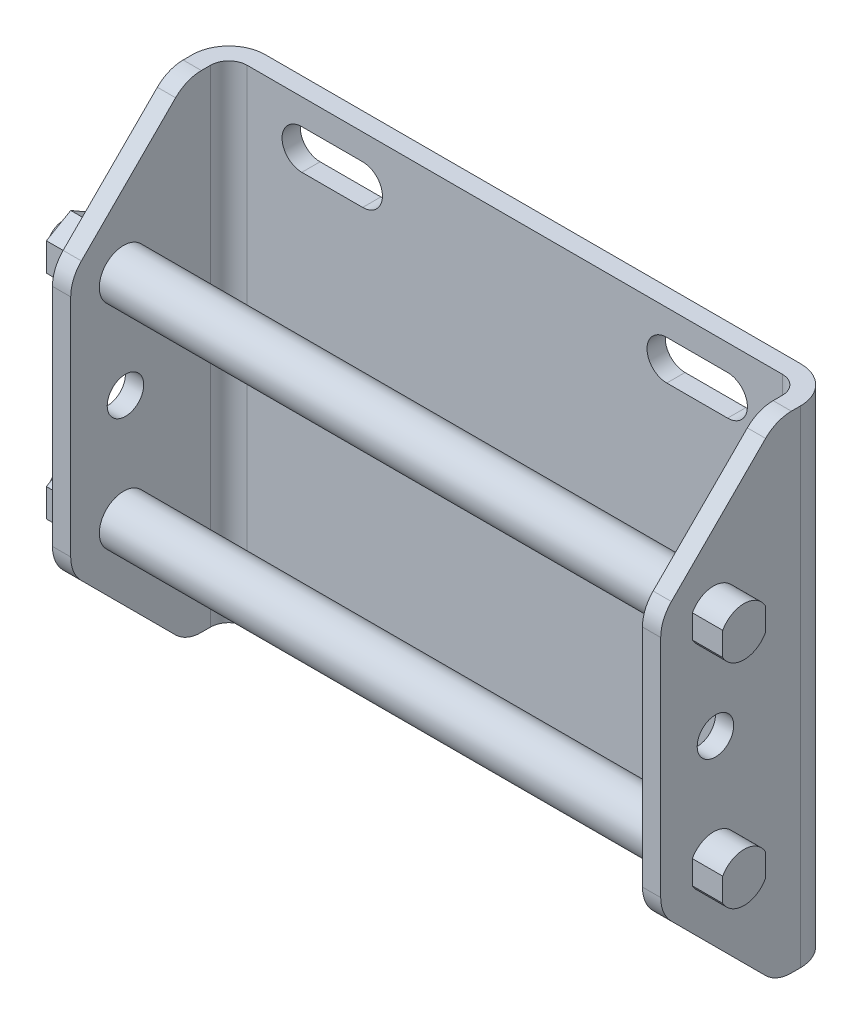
ISO-10303-21;
HEADER;
FILE_DESCRIPTION(('STEP AP214'),'2;1');
FILE_NAME('part.step','',(''),(''),'','','');
FILE_SCHEMA(('AUTOMOTIVE_DESIGN { 1 0 10303 214 1 1 1 1 }'));
ENDSEC;
DATA;
#1=APPLICATION_CONTEXT('core data for automotive mechanical design processes');
#2=APPLICATION_PROTOCOL_DEFINITION('international standard','automotive_design',2000,#1);
#3=PRODUCT_CONTEXT('',#1,'mechanical');
#4=PRODUCT('Part','Part','',(#3));
#5=PRODUCT_RELATED_PRODUCT_CATEGORY('part','',(#4));
#6=PRODUCT_DEFINITION_FORMATION('','',#4);
#7=PRODUCT_DEFINITION_CONTEXT('part definition',#1,'design');
#8=PRODUCT_DEFINITION('design','',#6,#7);
#9=PRODUCT_DEFINITION_SHAPE('','',#8);
#10=(LENGTH_UNIT() NAMED_UNIT(*) SI_UNIT(.MILLI.,.METRE.));
#11=(NAMED_UNIT(*) PLANE_ANGLE_UNIT() SI_UNIT($,.RADIAN.));
#12=(NAMED_UNIT(*) SI_UNIT($,.STERADIAN.) SOLID_ANGLE_UNIT());
#13=UNCERTAINTY_MEASURE_WITH_UNIT(LENGTH_MEASURE(1.E-05),#10,'distance_accuracy_value','');
#14=(GEOMETRIC_REPRESENTATION_CONTEXT(3) GLOBAL_UNCERTAINTY_ASSIGNED_CONTEXT((#13)) GLOBAL_UNIT_ASSIGNED_CONTEXT((#10,
#11,#12)) REPRESENTATION_CONTEXT('',''));
#15=CARTESIAN_POINT('',(0.,0.,0.));
#16=DIRECTION('',(0.,0.,1.));
#17=DIRECTION('',(1.,0.,0.));
#18=AXIS2_PLACEMENT_3D('',#15,#16,#17);
#19=CARTESIAN_POINT('',(85.,-1.5,7.51471862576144));
#20=DIRECTION('',(-1.,0.,0.));
#21=DIRECTION('',(0.,0.,1.));
#22=AXIS2_PLACEMENT_3D('',#19,#20,#21);
#23=PLANE('',#22);
#24=CARTESIAN_POINT('',(85.,32.5,20.));
#25=DIRECTION('',(-1.,0.,0.));
#26=DIRECTION('',(0.,0.,1.));
#27=AXIS2_PLACEMENT_3D('',#24,#25,#26);
#28=CIRCLE('',#27,3.);
#29=CARTESIAN_POINT('',(85.,32.5,23.));
#30=VERTEX_POINT('',#29);
#31=EDGE_CURVE('E468',#30,#30,#28,.T.);
#32=ORIENTED_EDGE('',*,*,#31,.T.);
#33=EDGE_LOOP('',(#32));
#34=FACE_BOUND('',#33,.T.);
#35=CARTESIAN_POINT('',(85.,50.,20.3));
#36=DIRECTION('',(1.,0.,0.));
#37=DIRECTION('',(0.,0.,-1.));
#38=AXIS2_PLACEMENT_3D('',#35,#36,#37);
#39=CIRCLE('',#38,4.);
#40=CARTESIAN_POINT('',(85.,48.0635083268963,23.8));
#41=VERTEX_POINT('',#40);
#42=CARTESIAN_POINT('',(85.,48.0635083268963,16.8));
#43=VERTEX_POINT('',#42);
#44=EDGE_CURVE('E497',#41,#43,#39,.T.);
#45=ORIENTED_EDGE('',*,*,#44,.F.);
#46=DIRECTION('',(0.,1.,0.));
#47=VECTOR('',#46,1.);
#48=CARTESIAN_POINT('',(85.,48.0635083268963,23.8));
#49=LINE('',#48,#47);
#50=CARTESIAN_POINT('',(85.,51.9364916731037,23.8));
#51=VERTEX_POINT('',#50);
#52=EDGE_CURVE('E504',#41,#51,#49,.T.);
#53=ORIENTED_EDGE('',*,*,#52,.T.);
#54=CARTESIAN_POINT('',(85.,51.9364916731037,16.8));
#55=VERTEX_POINT('',#54);
#56=EDGE_CURVE('E501',#55,#51,#39,.T.);
#57=ORIENTED_EDGE('',*,*,#56,.F.);
#58=DIRECTION('',(0.,1.,0.));
#59=VECTOR('',#58,1.);
#60=CARTESIAN_POINT('',(85.,48.0635083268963,16.8));
#61=LINE('',#60,#59);
#62=EDGE_CURVE('E498',#43,#55,#61,.T.);
#63=ORIENTED_EDGE('',*,*,#62,.F.);
#64=EDGE_LOOP('',(#45,#53,#57,#63));
#65=FACE_BOUND('',#64,.T.);
#66=DIRECTION('',(0.,0.,1.));
#67=VECTOR('',#66,1.);
#68=CARTESIAN_POINT('',(85.,-7.5,0.));
#69=LINE('',#68,#67);
#70=CARTESIAN_POINT('',(85.,-7.5,6.));
#71=VERTEX_POINT('',#70);
#72=CARTESIAN_POINT('',(85.,-7.5,7.51471862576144));
#73=VERTEX_POINT('',#72);
#74=EDGE_CURVE('E816',#71,#73,#69,.T.);
#75=ORIENTED_EDGE('',*,*,#74,.F.);
#76=DIRECTION('',(0.,1.,0.));
#77=VECTOR('',#76,1.);
#78=CARTESIAN_POINT('',(85.,-1.5,6.));
#79=LINE('',#78,#77);
#80=CARTESIAN_POINT('',(85.,72.5,6.));
#81=VERTEX_POINT('',#80);
#82=EDGE_CURVE('E926',#71,#81,#79,.T.);
#83=ORIENTED_EDGE('',*,*,#82,.T.);
#84=DIRECTION('',(0.,0.,1.));
#85=VECTOR('',#84,1.);
#86=CARTESIAN_POINT('',(85.,72.5,0.));
#87=LINE('',#86,#85);
#88=CARTESIAN_POINT('',(85.,72.5,7.51471862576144));
#89=VERTEX_POINT('',#88);
#90=EDGE_CURVE('E839',#81,#89,#87,.T.);
#91=ORIENTED_EDGE('',*,*,#90,.T.);
#92=CARTESIAN_POINT('',(85.,66.5,7.51471862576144));
#93=DIRECTION('',(1.,0.,0.));
#94=DIRECTION('',(0.,0.,-1.));
#95=AXIS2_PLACEMENT_3D('',#92,#93,#94);
#96=CIRCLE('',#95,6.);
#97=CARTESIAN_POINT('',(85.,70.7426406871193,11.7573593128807));
#98=VERTEX_POINT('',#97);
#99=EDGE_CURVE('E836',#89,#98,#96,.T.);
#100=ORIENTED_EDGE('',*,*,#99,.T.);
#101=DIRECTION('',(0.,-0.707106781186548,0.707106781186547));
#102=VECTOR('',#101,1.);
#103=CARTESIAN_POINT('',(85.,70.7426406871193,11.7573593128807));
#104=LINE('',#103,#102);
#105=CARTESIAN_POINT('',(85.,55.2573593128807,27.2426406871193));
#106=VERTEX_POINT('',#105);
#107=EDGE_CURVE('E833',#98,#106,#104,.T.);
#108=ORIENTED_EDGE('',*,*,#107,.T.);
#109=CARTESIAN_POINT('',(85.,51.0147186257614,23.));
#110=DIRECTION('',(1.,0.,0.));
#111=DIRECTION('',(0.,0.,-1.));
#112=AXIS2_PLACEMENT_3D('',#109,#110,#111);
#113=CIRCLE('',#112,6.);
#114=CARTESIAN_POINT('',(85.,51.0147186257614,29.));
#115=VERTEX_POINT('',#114);
#116=EDGE_CURVE('E830',#106,#115,#113,.T.);
#117=ORIENTED_EDGE('',*,*,#116,.T.);
#118=DIRECTION('',(0.,1.,0.));
#119=VECTOR('',#118,1.);
#120=CARTESIAN_POINT('',(85.,13.9852813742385,29.));
#121=LINE('',#120,#119);
#122=CARTESIAN_POINT('',(85.,13.9852813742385,29.));
#123=VERTEX_POINT('',#122);
#124=EDGE_CURVE('E827',#123,#115,#121,.T.);
#125=ORIENTED_EDGE('',*,*,#124,.F.);
#126=CARTESIAN_POINT('',(85.,13.9852813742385,23.));
#127=DIRECTION('',(-1.,0.,0.));
#128=DIRECTION('',(0.,0.,1.));
#129=AXIS2_PLACEMENT_3D('',#126,#127,#128);
#130=CIRCLE('',#129,6.);
#131=CARTESIAN_POINT('',(85.,9.7426406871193,27.2426406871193));
#132=VERTEX_POINT('',#131);
#133=EDGE_CURVE('E824',#132,#123,#130,.T.);
#134=ORIENTED_EDGE('',*,*,#133,.F.);
#135=DIRECTION('',(0.,0.707106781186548,0.707106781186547));
#136=VECTOR('',#135,1.);
#137=CARTESIAN_POINT('',(85.,-5.7426406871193,11.7573593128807));
#138=LINE('',#137,#136);
#139=CARTESIAN_POINT('',(85.,-5.7426406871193,11.7573593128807));
#140=VERTEX_POINT('',#139);
#141=EDGE_CURVE('E821',#140,#132,#138,.T.);
#142=ORIENTED_EDGE('',*,*,#141,.F.);
#143=CARTESIAN_POINT('',(85.,-1.5,7.51471862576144));
#144=DIRECTION('',(-1.,0.,0.));
#145=DIRECTION('',(0.,0.,1.));
#146=AXIS2_PLACEMENT_3D('',#143,#144,#145);
#147=CIRCLE('',#146,6.);
#148=EDGE_CURVE('E818',#73,#140,#147,.T.);
#149=ORIENTED_EDGE('',*,*,#148,.F.);
#150=EDGE_LOOP('',(#75,#83,#91,#100,#108,#117,#125,#134,#142,#149));
#151=FACE_BOUND('',#150,.T.);
#152=CARTESIAN_POINT('',(85.,15.,20.3));
#153=DIRECTION('',(1.,0.,0.));
#154=DIRECTION('',(0.,0.,-1.));
#155=AXIS2_PLACEMENT_3D('',#152,#153,#154);
#156=CIRCLE('',#155,4.);
#157=CARTESIAN_POINT('',(85.,16.9364916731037,16.8));
#158=VERTEX_POINT('',#157);
#159=CARTESIAN_POINT('',(85.,16.9364916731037,23.8));
#160=VERTEX_POINT('',#159);
#161=EDGE_CURVE('E462',#158,#160,#156,.T.);
#162=ORIENTED_EDGE('',*,*,#161,.F.);
#163=DIRECTION('',(0.,1.,0.));
#164=VECTOR('',#163,1.);
#165=CARTESIAN_POINT('',(85.,13.0635083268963,16.8));
#166=LINE('',#165,#164);
#167=CARTESIAN_POINT('',(85.,13.0635083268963,16.8));
#168=VERTEX_POINT('',#167);
#169=EDGE_CURVE('E465',#168,#158,#166,.T.);
#170=ORIENTED_EDGE('',*,*,#169,.F.);
#171=CARTESIAN_POINT('',(85.,13.0635083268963,23.8));
#172=VERTEX_POINT('',#171);
#173=EDGE_CURVE('E36',#172,#168,#156,.T.);
#174=ORIENTED_EDGE('',*,*,#173,.F.);
#175=DIRECTION('',(0.,1.,0.));
#176=VECTOR('',#175,1.);
#177=CARTESIAN_POINT('',(85.,13.0635083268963,23.8));
#178=LINE('',#177,#176);
#179=EDGE_CURVE('E31',#172,#160,#178,.T.);
#180=ORIENTED_EDGE('',*,*,#179,.T.);
#181=EDGE_LOOP('',(#162,#170,#174,#180));
#182=FACE_BOUND('',#181,.T.);
#183=ADVANCED_FACE('F14',(#34,#65,#151,#182),#23,.F.);
#184=CARTESIAN_POINT('',(-20.7,43.0717967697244,24.3));
#185=DIRECTION('',(1.,0.,0.));
#186=DIRECTION('',(0.,0.,-1.));
#187=AXIS2_PLACEMENT_3D('',#184,#185,#186);
#188=PLANE('',#187);
#189=DIRECTION('',(0.,1.,0.));
#190=VECTOR('',#189,1.);
#191=CARTESIAN_POINT('',(-20.7,47.6905989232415,24.3));
#192=LINE('',#191,#190);
#193=CARTESIAN_POINT('',(-20.7,47.6905989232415,24.3));
#194=VERTEX_POINT('',#193);
#195=CARTESIAN_POINT('',(-20.7,52.3094010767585,24.3));
#196=VERTEX_POINT('',#195);
#197=EDGE_CURVE('E569',#194,#196,#192,.T.);
#198=ORIENTED_EDGE('',*,*,#197,.T.);
#199=DIRECTION('',(0.,0.5,-0.866025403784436));
#200=VECTOR('',#199,1.);
#201=CARTESIAN_POINT('',(-20.7,52.3094010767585,24.3));
#202=LINE('',#201,#200);
#203=CARTESIAN_POINT('',(-20.7,54.6188021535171,20.3));
#204=VERTEX_POINT('',#203);
#205=EDGE_CURVE('E573',#196,#204,#202,.T.);
#206=ORIENTED_EDGE('',*,*,#205,.T.);
#207=DIRECTION('',(0.,0.5,0.866025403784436));
#208=VECTOR('',#207,1.);
#209=CARTESIAN_POINT('',(-20.7,52.3094010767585,16.3));
#210=LINE('',#209,#208);
#211=CARTESIAN_POINT('',(-20.7,52.3094010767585,16.3));
#212=VERTEX_POINT('',#211);
#213=EDGE_CURVE('E576',#212,#204,#210,.T.);
#214=ORIENTED_EDGE('',*,*,#213,.F.);
#215=DIRECTION('',(0.,1.,0.));
#216=VECTOR('',#215,1.);
#217=CARTESIAN_POINT('',(-20.7,47.6905989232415,16.3));
#218=LINE('',#217,#216);
#219=CARTESIAN_POINT('',(-20.7,47.6905989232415,16.3));
#220=VERTEX_POINT('',#219);
#221=EDGE_CURVE('E579',#220,#212,#218,.T.);
#222=ORIENTED_EDGE('',*,*,#221,.F.);
#223=DIRECTION('',(0.,-0.5,0.866025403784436));
#224=VECTOR('',#223,1.);
#225=CARTESIAN_POINT('',(-20.7,47.6905989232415,16.3));
#226=LINE('',#225,#224);
#227=CARTESIAN_POINT('',(-20.7,45.381197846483,20.3));
#228=VERTEX_POINT('',#227);
#229=EDGE_CURVE('E582',#220,#228,#226,.T.);
#230=ORIENTED_EDGE('',*,*,#229,.T.);
#231=DIRECTION('',(0.,-0.5,-0.866025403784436));
#232=VECTOR('',#231,1.);
#233=CARTESIAN_POINT('',(-20.7,47.6905989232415,24.3));
#234=LINE('',#233,#232);
#235=EDGE_CURVE('E585',#194,#228,#234,.T.);
#236=ORIENTED_EDGE('',*,*,#235,.F.);
#237=EDGE_LOOP('',(#198,#206,#214,#222,#230,#236));
#238=FACE_BOUND('',#237,.T.);
#239=CARTESIAN_POINT('',(-20.7,50.,20.3));
#240=DIRECTION('',(-1.,0.,0.));
#241=DIRECTION('',(0.,0.,1.));
#242=AXIS2_PLACEMENT_3D('',#239,#240,#241);
#243=CIRCLE('',#242,2.5);
#244=CARTESIAN_POINT('',(-20.7,50.,22.8));
#245=VERTEX_POINT('',#244);
#246=EDGE_CURVE('E9',#245,#245,#243,.T.);
#247=ORIENTED_EDGE('',*,*,#246,.F.);
#248=EDGE_LOOP('',(#247));
#249=FACE_BOUND('',#248,.T.);
#250=ADVANCED_FACE('F1024',(#238,#249),#188,.F.);
#251=CARTESIAN_POINT('',(-16.7,50.,20.3));
#252=DIRECTION('',(-1.,0.,0.));
#253=DIRECTION('',(0.,0.,1.));
#254=AXIS2_PLACEMENT_3D('',#251,#252,#253);
#255=PLANE('',#254);
#256=CARTESIAN_POINT('',(-16.7,50.,20.3));
#257=DIRECTION('',(-1.,0.,0.));
#258=DIRECTION('',(0.,0.,1.));
#259=AXIS2_PLACEMENT_3D('',#256,#257,#258);
#260=CIRCLE('',#259,4.6);
#261=CARTESIAN_POINT('',(-16.7,45.4001167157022,20.3327684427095));
#262=VERTEX_POINT('',#261);
#263=CARTESIAN_POINT('',(-16.7,47.6716800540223,24.2672315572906));
#264=VERTEX_POINT('',#263);
#265=EDGE_CURVE('E1992',#262,#264,#260,.T.);
#266=ORIENTED_EDGE('',*,*,#265,.T.);
#267=DIRECTION('',(0.,-0.5,-0.866025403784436));
#268=VECTOR('',#267,1.);
#269=CARTESIAN_POINT('',(-16.7,47.6905989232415,24.3));
#270=LINE('',#269,#268);
#271=EDGE_CURVE('E570',#264,#262,#270,.T.);
#272=ORIENTED_EDGE('',*,*,#271,.T.);
#273=EDGE_LOOP('',(#266,#272));
#274=FACE_BOUND('',#273,.T.);
#275=ADVANCED_FACE('F1031',(#274),#255,.T.);
#276=DIRECTION('',(0.,1.,0.));
#277=VECTOR('',#276,1.);
#278=CARTESIAN_POINT('',(-16.7,47.6905989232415,24.3));
#279=LINE('',#278,#277);
#280=CARTESIAN_POINT('',(-16.7,47.7284366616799,24.3));
#281=VERTEX_POINT('',#280);
#282=CARTESIAN_POINT('',(-16.7,52.2715633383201,24.3));
#283=VERTEX_POINT('',#282);
#284=EDGE_CURVE('E538',#281,#283,#279,.T.);
#285=ORIENTED_EDGE('',*,*,#284,.F.);
#286=EDGE_CURVE('E671',#281,#283,#260,.T.);
#287=ORIENTED_EDGE('',*,*,#286,.T.);
#288=EDGE_LOOP('',(#285,#287));
#289=FACE_BOUND('',#288,.T.);
#290=ADVANCED_FACE('F1972',(#289),#255,.T.);
#291=CARTESIAN_POINT('',(-16.7,52.2715633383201,16.3));
#292=VERTEX_POINT('',#291);
#293=CARTESIAN_POINT('',(-16.7,47.7284366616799,16.3));
#294=VERTEX_POINT('',#293);
#295=EDGE_CURVE('E2018',#292,#294,#260,.T.);
#296=ORIENTED_EDGE('',*,*,#295,.T.);
#297=DIRECTION('',(0.,1.,0.));
#298=VECTOR('',#297,1.);
#299=CARTESIAN_POINT('',(-16.7,47.6905989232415,16.3));
#300=LINE('',#299,#298);
#301=EDGE_CURVE('E560',#294,#292,#300,.T.);
#302=ORIENTED_EDGE('',*,*,#301,.T.);
#303=EDGE_LOOP('',(#296,#302));
#304=FACE_BOUND('',#303,.T.);
#305=ADVANCED_FACE('F1963',(#304),#255,.T.);
#306=CARTESIAN_POINT('',(-16.7,54.5998832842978,20.2672315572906));
#307=VERTEX_POINT('',#306);
#308=CARTESIAN_POINT('',(-16.7,52.3283199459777,16.3327684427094));
#309=VERTEX_POINT('',#308);
#310=EDGE_CURVE('E2025',#307,#309,#260,.T.);
#311=ORIENTED_EDGE('',*,*,#310,.T.);
#312=DIRECTION('',(0.,0.5,0.866025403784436));
#313=VECTOR('',#312,1.);
#314=CARTESIAN_POINT('',(-16.7,52.3094010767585,16.3));
#315=LINE('',#314,#313);
#316=EDGE_CURVE('E555',#309,#307,#315,.T.);
#317=ORIENTED_EDGE('',*,*,#316,.T.);
#318=EDGE_LOOP('',(#311,#317));
#319=FACE_BOUND('',#318,.T.);
#320=ADVANCED_FACE('F1954',(#319),#255,.T.);
#321=DIRECTION('',(0.,-0.5,0.866025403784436));
#322=VECTOR('',#321,1.);
#323=CARTESIAN_POINT('',(-16.7,47.6905989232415,16.3));
#324=LINE('',#323,#322);
#325=CARTESIAN_POINT('',(-16.7,47.6716800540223,16.3327684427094));
#326=VERTEX_POINT('',#325);
#327=CARTESIAN_POINT('',(-16.7,45.4001167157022,20.2672315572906));
#328=VERTEX_POINT('',#327);
#329=EDGE_CURVE('E565',#326,#328,#324,.T.);
#330=ORIENTED_EDGE('',*,*,#329,.F.);
#331=EDGE_CURVE('E2015',#326,#328,#260,.T.);
#332=ORIENTED_EDGE('',*,*,#331,.T.);
#333=EDGE_LOOP('',(#330,#332));
#334=FACE_BOUND('',#333,.T.);
#335=ADVANCED_FACE('F1682',(#334),#255,.T.);
#336=CARTESIAN_POINT('',(-16.7,15.,20.3));
#337=DIRECTION('',(-1.,0.,0.));
#338=DIRECTION('',(0.,0.,1.));
#339=AXIS2_PLACEMENT_3D('',#336,#337,#338);
#340=PLANE('',#339);
#341=CARTESIAN_POINT('',(-16.7,15.,20.3));
#342=DIRECTION('',(-1.,0.,0.));
#343=DIRECTION('',(0.,0.,1.));
#344=AXIS2_PLACEMENT_3D('',#341,#342,#343);
#345=CIRCLE('',#344,4.6);
#346=CARTESIAN_POINT('',(-16.7,19.5998832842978,20.2672315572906));
#347=VERTEX_POINT('',#346);
#348=CARTESIAN_POINT('',(-16.7,17.3283199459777,16.3327684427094));
#349=VERTEX_POINT('',#348);
#350=EDGE_CURVE('E2091',#347,#349,#345,.T.);
#351=ORIENTED_EDGE('',*,*,#350,.T.);
#352=DIRECTION('',(0.,0.5,0.866025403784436));
#353=VECTOR('',#352,1.);
#354=CARTESIAN_POINT('',(-16.7,17.3094010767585,16.3));
#355=LINE('',#354,#353);
#356=EDGE_CURVE('E634',#349,#347,#355,.T.);
#357=ORIENTED_EDGE('',*,*,#356,.T.);
#358=EDGE_LOOP('',(#351,#357));
#359=FACE_BOUND('',#358,.T.);
#360=ADVANCED_FACE('F1701',(#359),#340,.T.);
#361=DIRECTION('',(0.,-1.,0.));
#362=VECTOR('',#361,1.);
#363=CARTESIAN_POINT('',(-16.7,17.3094010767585,16.3));
#364=LINE('',#363,#362);
#365=CARTESIAN_POINT('',(-16.7,17.2715633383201,16.3));
#366=VERTEX_POINT('',#365);
#367=CARTESIAN_POINT('',(-16.7,12.7284366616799,16.3));
#368=VERTEX_POINT('',#367);
#369=EDGE_CURVE('E609',#366,#368,#364,.T.);
#370=ORIENTED_EDGE('',*,*,#369,.F.);
#371=EDGE_CURVE('E2052',#366,#368,#345,.T.);
#372=ORIENTED_EDGE('',*,*,#371,.T.);
#373=EDGE_LOOP('',(#370,#372));
#374=FACE_BOUND('',#373,.T.);
#375=ADVANCED_FACE('F1929',(#374),#340,.T.);
#376=CARTESIAN_POINT('',(-16.7,12.7284366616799,24.3));
#377=VERTEX_POINT('',#376);
#378=CARTESIAN_POINT('',(-16.7,17.2715633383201,24.3));
#379=VERTEX_POINT('',#378);
#380=EDGE_CURVE('E675',#377,#379,#345,.T.);
#381=ORIENTED_EDGE('',*,*,#380,.T.);
#382=DIRECTION('',(0.,-1.,0.));
#383=VECTOR('',#382,1.);
#384=CARTESIAN_POINT('',(-16.7,17.3094010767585,24.3));
#385=LINE('',#384,#383);
#386=EDGE_CURVE('E624',#379,#377,#385,.T.);
#387=ORIENTED_EDGE('',*,*,#386,.T.);
#388=EDGE_LOOP('',(#381,#387));
#389=FACE_BOUND('',#388,.T.);
#390=ADVANCED_FACE('F1920',(#389),#340,.T.);
#391=CARTESIAN_POINT('',(-16.7,10.4001167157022,20.3327684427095));
#392=VERTEX_POINT('',#391);
#393=CARTESIAN_POINT('',(-16.7,12.6716800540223,24.2672315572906));
#394=VERTEX_POINT('',#393);
#395=EDGE_CURVE('E2058',#392,#394,#345,.T.);
#396=ORIENTED_EDGE('',*,*,#395,.T.);
#397=DIRECTION('',(0.,-0.5,-0.866025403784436));
#398=VECTOR('',#397,1.);
#399=CARTESIAN_POINT('',(-16.7,12.6905989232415,24.3));
#400=LINE('',#399,#398);
#401=EDGE_CURVE('E619',#394,#392,#400,.T.);
#402=ORIENTED_EDGE('',*,*,#401,.T.);
#403=EDGE_LOOP('',(#396,#402));
#404=FACE_BOUND('',#403,.T.);
#405=ADVANCED_FACE('F1911',(#404),#340,.T.);
#406=DIRECTION('',(0.,0.5,-0.866025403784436));
#407=VECTOR('',#406,1.);
#408=CARTESIAN_POINT('',(-16.7,17.3094010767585,24.3));
#409=LINE('',#408,#407);
#410=CARTESIAN_POINT('',(-16.7,17.3283199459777,24.2672315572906));
#411=VERTEX_POINT('',#410);
#412=CARTESIAN_POINT('',(-16.7,19.5998832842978,20.3327684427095));
#413=VERTEX_POINT('',#412);
#414=EDGE_CURVE('E629',#411,#413,#409,.T.);
#415=ORIENTED_EDGE('',*,*,#414,.F.);
#416=EDGE_CURVE('E685',#411,#413,#345,.T.);
#417=ORIENTED_EDGE('',*,*,#416,.T.);
#418=EDGE_LOOP('',(#415,#417));
#419=FACE_BOUND('',#418,.T.);
#420=ADVANCED_FACE('F1043',(#419),#340,.T.);
#421=CARTESIAN_POINT('',(-15.,-1.5,7.51471862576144));
#422=DIRECTION('',(-1.,0.,0.));
#423=DIRECTION('',(0.,0.,1.));
#424=AXIS2_PLACEMENT_3D('',#421,#422,#423);
#425=PLANE('',#424);
#426=CARTESIAN_POINT('',(-15.,32.5,20.));
#427=DIRECTION('',(-1.,0.,0.));
#428=DIRECTION('',(0.,0.,1.));
#429=AXIS2_PLACEMENT_3D('',#426,#427,#428);
#430=CIRCLE('',#429,3.);
#431=CARTESIAN_POINT('',(-15.,32.5,23.));
#432=VERTEX_POINT('',#431);
#433=EDGE_CURVE('E528',#432,#432,#430,.T.);
#434=ORIENTED_EDGE('',*,*,#433,.F.);
#435=EDGE_LOOP('',(#434));
#436=FACE_BOUND('',#435,.T.);
#437=DIRECTION('',(0.,0.,1.));
#438=VECTOR('',#437,1.);
#439=CARTESIAN_POINT('',(-15.,72.5,0.));
#440=LINE('',#439,#438);
#441=CARTESIAN_POINT('',(-15.,72.5,6.));
#442=VERTEX_POINT('',#441);
#443=CARTESIAN_POINT('',(-15.,72.5,7.51471862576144));
#444=VERTEX_POINT('',#443);
#445=EDGE_CURVE('E864',#442,#444,#440,.T.);
#446=ORIENTED_EDGE('',*,*,#445,.F.);
#447=DIRECTION('',(0.,1.,0.));
#448=VECTOR('',#447,1.);
#449=CARTESIAN_POINT('',(-15.,-1.5,6.));
#450=LINE('',#449,#448);
#451=CARTESIAN_POINT('',(-15.,-7.5,6.));
#452=VERTEX_POINT('',#451);
#453=EDGE_CURVE('E920',#442,#452,#450,.F.);
#454=ORIENTED_EDGE('',*,*,#453,.T.);
#455=DIRECTION('',(0.,0.,1.));
#456=VECTOR('',#455,1.);
#457=CARTESIAN_POINT('',(-15.,-7.5,0.));
#458=LINE('',#457,#456);
#459=CARTESIAN_POINT('',(-15.,-7.5,7.51471862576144));
#460=VERTEX_POINT('',#459);
#461=EDGE_CURVE('E841',#452,#460,#458,.T.);
#462=ORIENTED_EDGE('',*,*,#461,.T.);
#463=CARTESIAN_POINT('',(-15.,-1.5,7.51471862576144));
#464=DIRECTION('',(-1.,0.,0.));
#465=DIRECTION('',(0.,0.,1.));
#466=AXIS2_PLACEMENT_3D('',#463,#464,#465);
#467=CIRCLE('',#466,6.);
#468=CARTESIAN_POINT('',(-15.,-5.7426406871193,11.7573593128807));
#469=VERTEX_POINT('',#468);
#470=EDGE_CURVE('E843',#460,#469,#467,.T.);
#471=ORIENTED_EDGE('',*,*,#470,.T.);
#472=DIRECTION('',(0.,0.707106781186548,0.707106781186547));
#473=VECTOR('',#472,1.);
#474=CARTESIAN_POINT('',(-15.,-5.7426406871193,11.7573593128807));
#475=LINE('',#474,#473);
#476=CARTESIAN_POINT('',(-15.,9.7426406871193,27.2426406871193));
#477=VERTEX_POINT('',#476);
#478=EDGE_CURVE('E846',#469,#477,#475,.T.);
#479=ORIENTED_EDGE('',*,*,#478,.T.);
#480=CARTESIAN_POINT('',(-15.,13.9852813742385,23.));
#481=DIRECTION('',(-1.,0.,0.));
#482=DIRECTION('',(0.,0.,1.));
#483=AXIS2_PLACEMENT_3D('',#480,#481,#482);
#484=CIRCLE('',#483,6.);
#485=CARTESIAN_POINT('',(-15.,13.9852813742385,29.));
#486=VERTEX_POINT('',#485);
#487=EDGE_CURVE('E849',#477,#486,#484,.T.);
#488=ORIENTED_EDGE('',*,*,#487,.T.);
#489=DIRECTION('',(0.,1.,0.));
#490=VECTOR('',#489,1.);
#491=CARTESIAN_POINT('',(-15.,13.9852813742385,29.));
#492=LINE('',#491,#490);
#493=CARTESIAN_POINT('',(-15.,51.0147186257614,29.));
#494=VERTEX_POINT('',#493);
#495=EDGE_CURVE('E852',#486,#494,#492,.T.);
#496=ORIENTED_EDGE('',*,*,#495,.T.);
#497=CARTESIAN_POINT('',(-15.,51.0147186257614,23.));
#498=DIRECTION('',(1.,0.,0.));
#499=DIRECTION('',(0.,0.,-1.));
#500=AXIS2_PLACEMENT_3D('',#497,#498,#499);
#501=CIRCLE('',#500,6.);
#502=CARTESIAN_POINT('',(-15.,55.2573593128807,27.2426406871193));
#503=VERTEX_POINT('',#502);
#504=EDGE_CURVE('E855',#503,#494,#501,.T.);
#505=ORIENTED_EDGE('',*,*,#504,.F.);
#506=DIRECTION('',(0.,-0.707106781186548,0.707106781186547));
#507=VECTOR('',#506,1.);
#508=CARTESIAN_POINT('',(-15.,70.7426406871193,11.7573593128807));
#509=LINE('',#508,#507);
#510=CARTESIAN_POINT('',(-15.,70.7426406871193,11.7573593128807));
#511=VERTEX_POINT('',#510);
#512=EDGE_CURVE('E858',#511,#503,#509,.T.);
#513=ORIENTED_EDGE('',*,*,#512,.F.);
#514=CARTESIAN_POINT('',(-15.,66.5,7.51471862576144));
#515=DIRECTION('',(1.,0.,0.));
#516=DIRECTION('',(0.,0.,-1.));
#517=AXIS2_PLACEMENT_3D('',#514,#515,#516);
#518=CIRCLE('',#517,6.);
#519=EDGE_CURVE('E861',#444,#511,#518,.T.);
#520=ORIENTED_EDGE('',*,*,#519,.F.);
#521=EDGE_LOOP('',(#446,#454,#462,#471,#479,#488,#496,#505,#513,#520));
#522=FACE_BOUND('',#521,.T.);
#523=CARTESIAN_POINT('',(-15.,15.,20.3));
#524=DIRECTION('',(-1.,0.,0.));
#525=DIRECTION('',(0.,0.,1.));
#526=AXIS2_PLACEMENT_3D('',#523,#524,#525);
#527=CIRCLE('',#526,4.6);
#528=CARTESIAN_POINT('',(-15.,15.,24.9));
#529=VERTEX_POINT('',#528);
#530=EDGE_CURVE('E677',#529,#529,#527,.T.);
#531=ORIENTED_EDGE('',*,*,#530,.F.);
#532=EDGE_LOOP('',(#531));
#533=FACE_BOUND('',#532,.T.);
#534=CARTESIAN_POINT('',(-15.,50.,20.3));
#535=DIRECTION('',(-1.,0.,0.));
#536=DIRECTION('',(0.,0.,1.));
#537=AXIS2_PLACEMENT_3D('',#534,#535,#536);
#538=CIRCLE('',#537,4.6);
#539=CARTESIAN_POINT('',(-15.,50.,24.9));
#540=VERTEX_POINT('',#539);
#541=EDGE_CURVE('E668',#540,#540,#538,.T.);
#542=ORIENTED_EDGE('',*,*,#541,.F.);
#543=EDGE_LOOP('',(#542));
#544=FACE_BOUND('',#543,.T.);
#545=ADVANCED_FACE('F1040',(#436,#522,#533,#544),#425,.T.);
#546=CARTESIAN_POINT('',(-12.,-27.5,3.));
#547=DIRECTION('',(-1.,0.,0.));
#548=DIRECTION('',(0.,0.,1.));
#549=AXIS2_PLACEMENT_3D('',#546,#547,#548);
#550=PLANE('',#549);
#551=CARTESIAN_POINT('',(-12.,32.5,20.));
#552=DIRECTION('',(-1.,0.,0.));
#553=DIRECTION('',(0.,0.,1.));
#554=AXIS2_PLACEMENT_3D('',#551,#552,#553);
#555=CIRCLE('',#554,3.);
#556=CARTESIAN_POINT('',(-12.,32.5,23.));
#557=VERTEX_POINT('',#556);
#558=EDGE_CURVE('E530',#557,#557,#555,.T.);
#559=ORIENTED_EDGE('',*,*,#558,.T.);
#560=EDGE_LOOP('',(#559));
#561=FACE_BOUND('',#560,.T.);
#562=DIRECTION('',(0.,0.,1.));
#563=VECTOR('',#562,1.);
#564=CARTESIAN_POINT('',(-12.,-7.5,0.));
#565=LINE('',#564,#563);
#566=CARTESIAN_POINT('',(-12.,-7.5,6.));
#567=VERTEX_POINT('',#566);
#568=CARTESIAN_POINT('',(-12.,-7.5,7.51471862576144));
#569=VERTEX_POINT('',#568);
#570=EDGE_CURVE('E814',#567,#569,#565,.T.);
#571=ORIENTED_EDGE('',*,*,#570,.F.);
#572=DIRECTION('',(0.,1.,0.));
#573=VECTOR('',#572,1.);
#574=CARTESIAN_POINT('',(-12.,-27.5,6.));
#575=LINE('',#574,#573);
#576=CARTESIAN_POINT('',(-12.,72.5,6.));
#577=VERTEX_POINT('',#576);
#578=EDGE_CURVE('E936',#567,#577,#575,.T.);
#579=ORIENTED_EDGE('',*,*,#578,.T.);
#580=DIRECTION('',(0.,0.,1.));
#581=VECTOR('',#580,1.);
#582=CARTESIAN_POINT('',(-12.,72.5,0.));
#583=LINE('',#582,#581);
#584=CARTESIAN_POINT('',(-12.,72.5,7.51471862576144));
#585=VERTEX_POINT('',#584);
#586=EDGE_CURVE('E909',#577,#585,#583,.T.);
#587=ORIENTED_EDGE('',*,*,#586,.T.);
#588=CARTESIAN_POINT('',(-12.,66.5,7.51471862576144));
#589=DIRECTION('',(-1.,0.,0.));
#590=DIRECTION('',(0.,0.,1.));
#591=AXIS2_PLACEMENT_3D('',#588,#589,#590);
#592=CIRCLE('',#591,6.);
#593=CARTESIAN_POINT('',(-12.,70.7426406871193,11.7573593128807));
#594=VERTEX_POINT('',#593);
#595=EDGE_CURVE('E796',#585,#594,#592,.F.);
#596=ORIENTED_EDGE('',*,*,#595,.T.);
#597=DIRECTION('',(0.,-0.707106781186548,0.707106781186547));
#598=VECTOR('',#597,1.);
#599=CARTESIAN_POINT('',(-12.,70.7426406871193,11.7573593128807));
#600=LINE('',#599,#598);
#601=CARTESIAN_POINT('',(-12.,55.2573593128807,27.2426406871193));
#602=VERTEX_POINT('',#601);
#603=EDGE_CURVE('E798',#594,#602,#600,.T.);
#604=ORIENTED_EDGE('',*,*,#603,.T.);
#605=CARTESIAN_POINT('',(-12.,51.0147186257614,23.));
#606=DIRECTION('',(-1.,0.,0.));
#607=DIRECTION('',(0.,0.,1.));
#608=AXIS2_PLACEMENT_3D('',#605,#606,#607);
#609=CIRCLE('',#608,6.);
#610=CARTESIAN_POINT('',(-12.,51.0147186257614,29.));
#611=VERTEX_POINT('',#610);
#612=EDGE_CURVE('E800',#602,#611,#609,.F.);
#613=ORIENTED_EDGE('',*,*,#612,.T.);
#614=DIRECTION('',(0.,1.,0.));
#615=VECTOR('',#614,1.);
#616=CARTESIAN_POINT('',(-12.,13.9852813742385,29.));
#617=LINE('',#616,#615);
#618=CARTESIAN_POINT('',(-12.,13.9852813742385,29.));
#619=VERTEX_POINT('',#618);
#620=EDGE_CURVE('E802',#619,#611,#617,.T.);
#621=ORIENTED_EDGE('',*,*,#620,.F.);
#622=CARTESIAN_POINT('',(-12.,13.9852813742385,23.));
#623=DIRECTION('',(-1.,0.,0.));
#624=DIRECTION('',(0.,0.,1.));
#625=AXIS2_PLACEMENT_3D('',#622,#623,#624);
#626=CIRCLE('',#625,6.);
#627=CARTESIAN_POINT('',(-12.,9.7426406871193,27.2426406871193));
#628=VERTEX_POINT('',#627);
#629=EDGE_CURVE('E805',#628,#619,#626,.T.);
#630=ORIENTED_EDGE('',*,*,#629,.F.);
#631=DIRECTION('',(0.,0.707106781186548,0.707106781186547));
#632=VECTOR('',#631,1.);
#633=CARTESIAN_POINT('',(-12.,-5.7426406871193,11.7573593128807));
#634=LINE('',#633,#632);
#635=CARTESIAN_POINT('',(-12.,-5.7426406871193,11.7573593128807));
#636=VERTEX_POINT('',#635);
#637=EDGE_CURVE('E808',#636,#628,#634,.T.);
#638=ORIENTED_EDGE('',*,*,#637,.F.);
#639=CARTESIAN_POINT('',(-12.,-1.5,7.51471862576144));
#640=DIRECTION('',(-1.,0.,0.));
#641=DIRECTION('',(0.,0.,1.));
#642=AXIS2_PLACEMENT_3D('',#639,#640,#641);
#643=CIRCLE('',#642,6.);
#644=EDGE_CURVE('E811',#569,#636,#643,.T.);
#645=ORIENTED_EDGE('',*,*,#644,.F.);
#646=EDGE_LOOP('',(#571,#579,#587,#596,#604,#613,#621,#630,#638,#645));
#647=FACE_BOUND('',#646,.T.);
#648=CARTESIAN_POINT('',(-12.,50.,20.3));
#649=DIRECTION('',(-1.,0.,0.));
#650=DIRECTION('',(0.,0.,1.));
#651=AXIS2_PLACEMENT_3D('',#648,#649,#650);
#652=CIRCLE('',#651,4.);
#653=CARTESIAN_POINT('',(-12.,50.,24.3));
#654=VERTEX_POINT('',#653);
#655=EDGE_CURVE('E689',#654,#654,#652,.T.);
#656=ORIENTED_EDGE('',*,*,#655,.T.);
#657=EDGE_LOOP('',(#656));
#658=FACE_BOUND('',#657,.T.);
#659=CARTESIAN_POINT('',(-12.,15.,20.3));
#660=DIRECTION('',(-1.,0.,0.));
#661=DIRECTION('',(0.,0.,1.));
#662=AXIS2_PLACEMENT_3D('',#659,#660,#661);
#663=CIRCLE('',#662,4.);
#664=CARTESIAN_POINT('',(-12.,15.,24.3));
#665=VERTEX_POINT('',#664);
#666=EDGE_CURVE('E680',#665,#665,#663,.F.);
#667=ORIENTED_EDGE('',*,*,#666,.F.);
#668=EDGE_LOOP('',(#667));
#669=FACE_BOUND('',#668,.T.);
#670=ADVANCED_FACE('F995',(#561,#647,#658,#669),#550,.F.);
#671=CARTESIAN_POINT('',(82.,-27.5,3.));
#672=DIRECTION('',(-1.,0.,0.));
#673=DIRECTION('',(0.,0.,1.));
#674=AXIS2_PLACEMENT_3D('',#671,#672,#673);
#675=PLANE('',#674);
#676=CARTESIAN_POINT('',(82.,32.5,20.));
#677=DIRECTION('',(-1.,0.,0.));
#678=DIRECTION('',(0.,0.,1.));
#679=AXIS2_PLACEMENT_3D('',#676,#677,#678);
#680=CIRCLE('',#679,3.);
#681=CARTESIAN_POINT('',(82.,32.5,23.));
#682=VERTEX_POINT('',#681);
#683=EDGE_CURVE('E18',#682,#682,#680,.T.);
#684=ORIENTED_EDGE('',*,*,#683,.F.);
#685=EDGE_LOOP('',(#684));
#686=FACE_BOUND('',#685,.T.);
#687=DIRECTION('',(0.,0.,1.));
#688=VECTOR('',#687,1.);
#689=CARTESIAN_POINT('',(82.,72.5,0.));
#690=LINE('',#689,#688);
#691=CARTESIAN_POINT('',(82.,72.5,6.));
#692=VERTEX_POINT('',#691);
#693=CARTESIAN_POINT('',(82.,72.5,7.51471862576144));
#694=VERTEX_POINT('',#693);
#695=EDGE_CURVE('E904',#692,#694,#690,.T.);
#696=ORIENTED_EDGE('',*,*,#695,.F.);
#697=DIRECTION('',(0.,1.,0.));
#698=VECTOR('',#697,1.);
#699=CARTESIAN_POINT('',(82.,-27.5,6.));
#700=LINE('',#699,#698);
#701=CARTESIAN_POINT('',(82.,-7.5,6.));
#702=VERTEX_POINT('',#701);
#703=EDGE_CURVE('E934',#692,#702,#700,.F.);
#704=ORIENTED_EDGE('',*,*,#703,.T.);
#705=DIRECTION('',(0.,0.,1.));
#706=VECTOR('',#705,1.);
#707=CARTESIAN_POINT('',(82.,-7.5,0.));
#708=LINE('',#707,#706);
#709=CARTESIAN_POINT('',(82.,-7.5,7.51471862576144));
#710=VERTEX_POINT('',#709);
#711=EDGE_CURVE('E791',#702,#710,#708,.T.);
#712=ORIENTED_EDGE('',*,*,#711,.T.);
#713=CARTESIAN_POINT('',(82.,-1.5,7.51471862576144));
#714=DIRECTION('',(-1.,0.,0.));
#715=DIRECTION('',(0.,0.,1.));
#716=AXIS2_PLACEMENT_3D('',#713,#714,#715);
#717=CIRCLE('',#716,6.);
#718=CARTESIAN_POINT('',(82.,-5.7426406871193,11.7573593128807));
#719=VERTEX_POINT('',#718);
#720=EDGE_CURVE('E789',#710,#719,#717,.T.);
#721=ORIENTED_EDGE('',*,*,#720,.T.);
#722=DIRECTION('',(0.,0.707106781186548,0.707106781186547));
#723=VECTOR('',#722,1.);
#724=CARTESIAN_POINT('',(82.,-5.7426406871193,11.7573593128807));
#725=LINE('',#724,#723);
#726=CARTESIAN_POINT('',(82.,9.7426406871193,27.2426406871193));
#727=VERTEX_POINT('',#726);
#728=EDGE_CURVE('E787',#719,#727,#725,.T.);
#729=ORIENTED_EDGE('',*,*,#728,.T.);
#730=CARTESIAN_POINT('',(82.,13.9852813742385,23.));
#731=DIRECTION('',(-1.,0.,0.));
#732=DIRECTION('',(0.,0.,1.));
#733=AXIS2_PLACEMENT_3D('',#730,#731,#732);
#734=CIRCLE('',#733,6.);
#735=CARTESIAN_POINT('',(82.,13.9852813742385,29.));
#736=VERTEX_POINT('',#735);
#737=EDGE_CURVE('E785',#727,#736,#734,.T.);
#738=ORIENTED_EDGE('',*,*,#737,.T.);
#739=DIRECTION('',(0.,1.,0.));
#740=VECTOR('',#739,1.);
#741=CARTESIAN_POINT('',(82.,13.9852813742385,29.));
#742=LINE('',#741,#740);
#743=CARTESIAN_POINT('',(82.,51.0147186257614,29.));
#744=VERTEX_POINT('',#743);
#745=EDGE_CURVE('E783',#736,#744,#742,.T.);
#746=ORIENTED_EDGE('',*,*,#745,.T.);
#747=CARTESIAN_POINT('',(82.,51.0147186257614,23.));
#748=DIRECTION('',(-1.,0.,0.));
#749=DIRECTION('',(0.,0.,1.));
#750=AXIS2_PLACEMENT_3D('',#747,#748,#749);
#751=CIRCLE('',#750,6.);
#752=CARTESIAN_POINT('',(82.,55.2573593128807,27.2426406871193));
#753=VERTEX_POINT('',#752);
#754=EDGE_CURVE('E780',#753,#744,#751,.F.);
#755=ORIENTED_EDGE('',*,*,#754,.F.);
#756=DIRECTION('',(0.,-0.707106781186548,0.707106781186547));
#757=VECTOR('',#756,1.);
#758=CARTESIAN_POINT('',(82.,70.7426406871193,11.7573593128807));
#759=LINE('',#758,#757);
#760=CARTESIAN_POINT('',(82.,70.7426406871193,11.7573593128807));
#761=VERTEX_POINT('',#760);
#762=EDGE_CURVE('E777',#761,#753,#759,.T.);
#763=ORIENTED_EDGE('',*,*,#762,.F.);
#764=CARTESIAN_POINT('',(82.,66.5,7.51471862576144));
#765=DIRECTION('',(-1.,0.,0.));
#766=DIRECTION('',(0.,0.,1.));
#767=AXIS2_PLACEMENT_3D('',#764,#765,#766);
#768=CIRCLE('',#767,6.);
#769=EDGE_CURVE('E774',#694,#761,#768,.F.);
#770=ORIENTED_EDGE('',*,*,#769,.F.);
#771=EDGE_LOOP('',(#696,#704,#712,#721,#729,#738,#746,#755,#763,#770));
#772=FACE_BOUND('',#771,.T.);
#773=CARTESIAN_POINT('',(82.,50.,20.3));
#774=DIRECTION('',(-1.,0.,0.));
#775=DIRECTION('',(0.,0.,1.));
#776=AXIS2_PLACEMENT_3D('',#773,#774,#775);
#777=CIRCLE('',#776,4.);
#778=CARTESIAN_POINT('',(82.,50.,24.3));
#779=VERTEX_POINT('',#778);
#780=EDGE_CURVE('E688',#779,#779,#777,.T.);
#781=ORIENTED_EDGE('',*,*,#780,.F.);
#782=EDGE_LOOP('',(#781));
#783=FACE_BOUND('',#782,.T.);
#784=CARTESIAN_POINT('',(82.,15.,20.3));
#785=DIRECTION('',(-1.,0.,0.));
#786=DIRECTION('',(0.,0.,1.));
#787=AXIS2_PLACEMENT_3D('',#784,#785,#786);
#788=CIRCLE('',#787,4.);
#789=CARTESIAN_POINT('',(82.,15.,24.3));
#790=VERTEX_POINT('',#789);
#791=EDGE_CURVE('E684',#790,#790,#788,.F.);
#792=ORIENTED_EDGE('',*,*,#791,.T.);
#793=EDGE_LOOP('',(#792));
#794=FACE_BOUND('',#793,.T.);
#795=ADVANCED_FACE('F1053',(#686,#772,#783,#794),#675,.T.);
#796=CARTESIAN_POINT('',(-15.,-7.5,0.));
#797=DIRECTION('',(0.,0.,-1.));
#798=DIRECTION('',(0.,-1.,0.));
#799=AXIS2_PLACEMENT_3D('',#796,#797,#798);
#800=PLANE('',#799);
#801=DIRECTION('',(1.,0.,0.));
#802=VECTOR('',#801,1.);
#803=CARTESIAN_POINT('',(60.,68.25,0.));
#804=LINE('',#803,#802);
#805=CARTESIAN_POINT('',(60.,68.25,0.));
#806=VERTEX_POINT('',#805);
#807=CARTESIAN_POINT('',(70.,68.25,0.));
#808=VERTEX_POINT('',#807);
#809=EDGE_CURVE('E742',#806,#808,#804,.T.);
#810=ORIENTED_EDGE('',*,*,#809,.F.);
#811=CARTESIAN_POINT('',(60.,65.,0.));
#812=DIRECTION('',(0.,0.,1.));
#813=DIRECTION('',(0.,1.,0.));
#814=AXIS2_PLACEMENT_3D('',#811,#812,#813);
#815=CIRCLE('',#814,3.25);
#816=CARTESIAN_POINT('',(60.,61.75,0.));
#817=VERTEX_POINT('',#816);
#818=EDGE_CURVE('E733',#806,#817,#815,.T.);
#819=ORIENTED_EDGE('',*,*,#818,.T.);
#820=DIRECTION('',(1.,0.,0.));
#821=VECTOR('',#820,1.);
#822=CARTESIAN_POINT('',(60.,61.75,0.));
#823=LINE('',#822,#821);
#824=CARTESIAN_POINT('',(70.,61.75,0.));
#825=VERTEX_POINT('',#824);
#826=EDGE_CURVE('E736',#817,#825,#823,.T.);
#827=ORIENTED_EDGE('',*,*,#826,.T.);
#828=CARTESIAN_POINT('',(70.,65.,0.));
#829=DIRECTION('',(0.,0.,1.));
#830=DIRECTION('',(0.,1.,0.));
#831=AXIS2_PLACEMENT_3D('',#828,#829,#830);
#832=CIRCLE('',#831,3.25);
#833=EDGE_CURVE('E739',#825,#808,#832,.T.);
#834=ORIENTED_EDGE('',*,*,#833,.T.);
#835=EDGE_LOOP('',(#810,#819,#827,#834));
#836=FACE_BOUND('',#835,.T.);
#837=CARTESIAN_POINT('',(60.,0.,0.));
#838=DIRECTION('',(0.,0.,-1.));
#839=DIRECTION('',(0.,-1.,0.));
#840=AXIS2_PLACEMENT_3D('',#837,#838,#839);
#841=CIRCLE('',#840,3.25);
#842=CARTESIAN_POINT('',(60.,-3.25,0.));
#843=VERTEX_POINT('',#842);
#844=CARTESIAN_POINT('',(60.,3.25,0.));
#845=VERTEX_POINT('',#844);
#846=EDGE_CURVE('E754',#843,#845,#841,.T.);
#847=ORIENTED_EDGE('',*,*,#846,.F.);
#848=DIRECTION('',(1.,0.,0.));
#849=VECTOR('',#848,1.);
#850=CARTESIAN_POINT('',(60.,-3.25,0.));
#851=LINE('',#850,#849);
#852=CARTESIAN_POINT('',(70.,-3.25,0.));
#853=VERTEX_POINT('',#852);
#854=EDGE_CURVE('E762',#843,#853,#851,.T.);
#855=ORIENTED_EDGE('',*,*,#854,.T.);
#856=CARTESIAN_POINT('',(70.,0.,0.));
#857=DIRECTION('',(0.,0.,-1.));
#858=DIRECTION('',(0.,-1.,0.));
#859=AXIS2_PLACEMENT_3D('',#856,#857,#858);
#860=CIRCLE('',#859,3.25);
#861=CARTESIAN_POINT('',(70.,3.25,0.));
#862=VERTEX_POINT('',#861);
#863=EDGE_CURVE('E759',#862,#853,#860,.T.);
#864=ORIENTED_EDGE('',*,*,#863,.F.);
#865=DIRECTION('',(1.,0.,0.));
#866=VECTOR('',#865,1.);
#867=CARTESIAN_POINT('',(60.,3.25,0.));
#868=LINE('',#867,#866);
#869=EDGE_CURVE('E756',#845,#862,#868,.T.);
#870=ORIENTED_EDGE('',*,*,#869,.F.);
#871=EDGE_LOOP('',(#847,#855,#864,#870));
#872=FACE_BOUND('',#871,.T.);
#873=DIRECTION('',(1.,0.,0.));
#874=VECTOR('',#873,1.);
#875=CARTESIAN_POINT('',(-15.,-7.5,0.));
#876=LINE('',#875,#874);
#877=CARTESIAN_POINT('',(-9.,-7.5,0.));
#878=VERTEX_POINT('',#877);
#879=CARTESIAN_POINT('',(79.,-7.5,0.));
#880=VERTEX_POINT('',#879);
#881=EDGE_CURVE('E866',#878,#880,#876,.T.);
#882=ORIENTED_EDGE('',*,*,#881,.F.);
#883=DIRECTION('',(0.,1.,0.));
#884=VECTOR('',#883,1.);
#885=CARTESIAN_POINT('',(-9.,-7.5,0.));
#886=LINE('',#885,#884);
#887=CARTESIAN_POINT('',(-9.,72.5,0.));
#888=VERTEX_POINT('',#887);
#889=EDGE_CURVE('E913',#878,#888,#886,.T.);
#890=ORIENTED_EDGE('',*,*,#889,.T.);
#891=DIRECTION('',(1.,0.,0.));
#892=VECTOR('',#891,1.);
#893=CARTESIAN_POINT('',(-15.,72.5,0.));
#894=LINE('',#893,#892);
#895=CARTESIAN_POINT('',(79.,72.5,0.));
#896=VERTEX_POINT('',#895);
#897=EDGE_CURVE('E869',#888,#896,#894,.T.);
#898=ORIENTED_EDGE('',*,*,#897,.T.);
#899=DIRECTION('',(0.,1.,0.));
#900=VECTOR('',#899,1.);
#901=CARTESIAN_POINT('',(79.,-1.5,0.));
#902=LINE('',#901,#900);
#903=EDGE_CURVE('E911',#896,#880,#902,.F.);
#904=ORIENTED_EDGE('',*,*,#903,.T.);
#905=EDGE_LOOP('',(#882,#890,#898,#904));
#906=FACE_BOUND('',#905,.T.);
#907=CARTESIAN_POINT('',(0.,65.,0.));
#908=DIRECTION('',(0.,0.,-1.));
#909=DIRECTION('',(0.,-1.,0.));
#910=AXIS2_PLACEMENT_3D('',#907,#908,#909);
#911=CIRCLE('',#910,3.25);
#912=CARTESIAN_POINT('',(0.,61.75,0.));
#913=VERTEX_POINT('',#912);
#914=CARTESIAN_POINT('',(0.,68.25,0.));
#915=VERTEX_POINT('',#914);
#916=EDGE_CURVE('E713',#913,#915,#911,.T.);
#917=ORIENTED_EDGE('',*,*,#916,.F.);
#918=DIRECTION('',(-1.,0.,0.));
#919=VECTOR('',#918,1.);
#920=CARTESIAN_POINT('',(10.,61.75,0.));
#921=LINE('',#920,#919);
#922=CARTESIAN_POINT('',(10.,61.75,0.));
#923=VERTEX_POINT('',#922);
#924=EDGE_CURVE('E721',#923,#913,#921,.T.);
#925=ORIENTED_EDGE('',*,*,#924,.F.);
#926=CARTESIAN_POINT('',(10.,65.,0.));
#927=DIRECTION('',(0.,0.,-1.));
#928=DIRECTION('',(0.,-1.,0.));
#929=AXIS2_PLACEMENT_3D('',#926,#927,#928);
#930=CIRCLE('',#929,3.25);
#931=CARTESIAN_POINT('',(10.,68.25,0.));
#932=VERTEX_POINT('',#931);
#933=EDGE_CURVE('E718',#932,#923,#930,.T.);
#934=ORIENTED_EDGE('',*,*,#933,.F.);
#935=DIRECTION('',(-1.,0.,0.));
#936=VECTOR('',#935,1.);
#937=CARTESIAN_POINT('',(10.,68.25,0.));
#938=LINE('',#937,#936);
#939=EDGE_CURVE('E715',#932,#915,#938,.T.);
#940=ORIENTED_EDGE('',*,*,#939,.T.);
#941=EDGE_LOOP('',(#917,#925,#934,#940));
#942=FACE_BOUND('',#941,.T.);
#943=DIRECTION('',(-1.,0.,0.));
#944=VECTOR('',#943,1.);
#945=CARTESIAN_POINT('',(10.,-3.25,0.));
#946=LINE('',#945,#944);
#947=CARTESIAN_POINT('',(10.,-3.25,0.));
#948=VERTEX_POINT('',#947);
#949=CARTESIAN_POINT('',(0.,-3.25,0.));
#950=VERTEX_POINT('',#949);
#951=EDGE_CURVE('E701',#948,#950,#946,.T.);
#952=ORIENTED_EDGE('',*,*,#951,.F.);
#953=CARTESIAN_POINT('',(10.,0.,0.));
#954=DIRECTION('',(0.,0.,1.));
#955=DIRECTION('',(0.,1.,0.));
#956=AXIS2_PLACEMENT_3D('',#953,#954,#955);
#957=CIRCLE('',#956,3.25);
#958=CARTESIAN_POINT('',(10.,3.25,0.));
#959=VERTEX_POINT('',#958);
#960=EDGE_CURVE('E692',#948,#959,#957,.T.);
#961=ORIENTED_EDGE('',*,*,#960,.T.);
#962=DIRECTION('',(-1.,0.,0.));
#963=VECTOR('',#962,1.);
#964=CARTESIAN_POINT('',(10.,3.25,0.));
#965=LINE('',#964,#963);
#966=CARTESIAN_POINT('',(0.,3.25,0.));
#967=VERTEX_POINT('',#966);
#968=EDGE_CURVE('E695',#959,#967,#965,.T.);
#969=ORIENTED_EDGE('',*,*,#968,.T.);
#970=CARTESIAN_POINT('',(0.,0.,0.));
#971=DIRECTION('',(0.,0.,1.));
#972=DIRECTION('',(0.,1.,0.));
#973=AXIS2_PLACEMENT_3D('',#970,#971,#972);
#974=CIRCLE('',#973,3.25);
#975=EDGE_CURVE('E698',#967,#950,#974,.T.);
#976=ORIENTED_EDGE('',*,*,#975,.T.);
#977=EDGE_LOOP('',(#952,#961,#969,#976));
#978=FACE_BOUND('',#977,.T.);
#979=ADVANCED_FACE('F1050',(#836,#872,#906,#942,#978),#800,.T.);
#980=CARTESIAN_POINT('',(-12.,-27.5,3.));
#981=DIRECTION('',(0.,0.,1.));
#982=DIRECTION('',(0.,1.,0.));
#983=AXIS2_PLACEMENT_3D('',#980,#981,#982);
#984=PLANE('',#983);
#985=DIRECTION('',(-1.,0.,0.));
#986=VECTOR('',#985,1.);
#987=CARTESIAN_POINT('',(-12.,61.75,3.));
#988=LINE('',#987,#986);
#989=CARTESIAN_POINT('',(70.,61.75,3.));
#990=VERTEX_POINT('',#989);
#991=CARTESIAN_POINT('',(60.,61.75,3.));
#992=VERTEX_POINT('',#991);
#993=EDGE_CURVE('E962',#990,#992,#988,.T.);
#994=ORIENTED_EDGE('',*,*,#993,.T.);
#995=CARTESIAN_POINT('',(60.,65.,3.));
#996=DIRECTION('',(0.,0.,1.));
#997=DIRECTION('',(0.,1.,0.));
#998=AXIS2_PLACEMENT_3D('',#995,#996,#997);
#999=CIRCLE('',#998,3.25);
#1000=CARTESIAN_POINT('',(60.,68.25,3.));
#1001=VERTEX_POINT('',#1000);
#1002=EDGE_CURVE('E965',#992,#1001,#999,.F.);
#1003=ORIENTED_EDGE('',*,*,#1002,.T.);
#1004=DIRECTION('',(-1.,0.,0.));
#1005=VECTOR('',#1004,1.);
#1006=CARTESIAN_POINT('',(-12.,68.25,3.));
#1007=LINE('',#1006,#1005);
#1008=CARTESIAN_POINT('',(70.,68.25,3.));
#1009=VERTEX_POINT('',#1008);
#1010=EDGE_CURVE('E957',#1009,#1001,#1007,.T.);
#1011=ORIENTED_EDGE('',*,*,#1010,.F.);
#1012=CARTESIAN_POINT('',(70.,65.,3.));
#1013=DIRECTION('',(0.,0.,1.));
#1014=DIRECTION('',(0.,1.,0.));
#1015=AXIS2_PLACEMENT_3D('',#1012,#1013,#1014);
#1016=CIRCLE('',#1015,3.25);
#1017=EDGE_CURVE('E959',#1009,#990,#1016,.F.);
#1018=ORIENTED_EDGE('',*,*,#1017,.T.);
#1019=EDGE_LOOP('',(#994,#1003,#1011,#1018));
#1020=FACE_BOUND('',#1019,.T.);
#1021=CARTESIAN_POINT('',(60.,0.,3.));
#1022=DIRECTION('',(0.,0.,1.));
#1023=DIRECTION('',(0.,1.,0.));
#1024=AXIS2_PLACEMENT_3D('',#1021,#1022,#1023);
#1025=CIRCLE('',#1024,3.25);
#1026=CARTESIAN_POINT('',(60.,3.25,3.));
#1027=VERTEX_POINT('',#1026);
#1028=CARTESIAN_POINT('',(60.,-3.25,3.));
#1029=VERTEX_POINT('',#1028);
#1030=EDGE_CURVE('E955',#1027,#1029,#1025,.T.);
#1031=ORIENTED_EDGE('',*,*,#1030,.F.);
#1032=DIRECTION('',(-1.,0.,0.));
#1033=VECTOR('',#1032,1.);
#1034=CARTESIAN_POINT('',(-12.,3.25,3.));
#1035=LINE('',#1034,#1033);
#1036=CARTESIAN_POINT('',(70.,3.25,3.));
#1037=VERTEX_POINT('',#1036);
#1038=EDGE_CURVE('E947',#1037,#1027,#1035,.T.);
#1039=ORIENTED_EDGE('',*,*,#1038,.F.);
#1040=CARTESIAN_POINT('',(70.,0.,3.));
#1041=DIRECTION('',(0.,0.,1.));
#1042=DIRECTION('',(0.,1.,0.));
#1043=AXIS2_PLACEMENT_3D('',#1040,#1041,#1042);
#1044=CIRCLE('',#1043,3.25);
#1045=CARTESIAN_POINT('',(70.,-3.25,3.));
#1046=VERTEX_POINT('',#1045);
#1047=EDGE_CURVE('E949',#1046,#1037,#1044,.T.);
#1048=ORIENTED_EDGE('',*,*,#1047,.F.);
#1049=DIRECTION('',(-1.,0.,0.));
#1050=VECTOR('',#1049,1.);
#1051=CARTESIAN_POINT('',(-12.,-3.25,3.));
#1052=LINE('',#1051,#1050);
#1053=EDGE_CURVE('E952',#1046,#1029,#1052,.T.);
#1054=ORIENTED_EDGE('',*,*,#1053,.T.);
#1055=EDGE_LOOP('',(#1031,#1039,#1048,#1054));
#1056=FACE_BOUND('',#1055,.T.);
#1057=DIRECTION('',(1.,0.,0.));
#1058=VECTOR('',#1057,1.);
#1059=CARTESIAN_POINT('',(-15.,-7.5,3.));
#1060=LINE('',#1059,#1058);
#1061=CARTESIAN_POINT('',(-9.,-7.5,3.));
#1062=VERTEX_POINT('',#1061);
#1063=CARTESIAN_POINT('',(79.,-7.5,3.));
#1064=VERTEX_POINT('',#1063);
#1065=EDGE_CURVE('E793',#1062,#1064,#1060,.T.);
#1066=ORIENTED_EDGE('',*,*,#1065,.T.);
#1067=DIRECTION('',(0.,1.,0.));
#1068=VECTOR('',#1067,1.);
#1069=CARTESIAN_POINT('',(79.,-27.5,3.));
#1070=LINE('',#1069,#1068);
#1071=CARTESIAN_POINT('',(79.,72.5,3.));
#1072=VERTEX_POINT('',#1071);
#1073=EDGE_CURVE('E931',#1064,#1072,#1070,.T.);
#1074=ORIENTED_EDGE('',*,*,#1073,.T.);
#1075=DIRECTION('',(1.,0.,0.));
#1076=VECTOR('',#1075,1.);
#1077=CARTESIAN_POINT('',(-15.,72.5,3.));
#1078=LINE('',#1077,#1076);
#1079=CARTESIAN_POINT('',(-9.,72.5,3.));
#1080=VERTEX_POINT('',#1079);
#1081=EDGE_CURVE('E906',#1080,#1072,#1078,.T.);
#1082=ORIENTED_EDGE('',*,*,#1081,.F.);
#1083=DIRECTION('',(0.,1.,0.));
#1084=VECTOR('',#1083,1.);
#1085=CARTESIAN_POINT('',(-9.,-27.5,3.));
#1086=LINE('',#1085,#1084);
#1087=EDGE_CURVE('E929',#1080,#1062,#1086,.F.);
#1088=ORIENTED_EDGE('',*,*,#1087,.T.);
#1089=EDGE_LOOP('',(#1066,#1074,#1082,#1088));
#1090=FACE_BOUND('',#1089,.T.);
#1091=CARTESIAN_POINT('',(0.,65.,3.));
#1092=DIRECTION('',(0.,0.,1.));
#1093=DIRECTION('',(0.,1.,0.));
#1094=AXIS2_PLACEMENT_3D('',#1091,#1092,#1093);
#1095=CIRCLE('',#1094,3.25);
#1096=CARTESIAN_POINT('',(0.,68.25,3.));
#1097=VERTEX_POINT('',#1096);
#1098=CARTESIAN_POINT('',(0.,61.75,3.));
#1099=VERTEX_POINT('',#1098);
#1100=EDGE_CURVE('E976',#1097,#1099,#1095,.T.);
#1101=ORIENTED_EDGE('',*,*,#1100,.F.);
#1102=DIRECTION('',(1.,0.,0.));
#1103=VECTOR('',#1102,1.);
#1104=CARTESIAN_POINT('',(-12.,68.25,3.));
#1105=LINE('',#1104,#1103);
#1106=CARTESIAN_POINT('',(10.,68.25,3.));
#1107=VERTEX_POINT('',#1106);
#1108=EDGE_CURVE('E968',#1097,#1107,#1105,.T.);
#1109=ORIENTED_EDGE('',*,*,#1108,.T.);
#1110=CARTESIAN_POINT('',(10.,65.,3.));
#1111=DIRECTION('',(0.,0.,1.));
#1112=DIRECTION('',(0.,1.,0.));
#1113=AXIS2_PLACEMENT_3D('',#1110,#1111,#1112);
#1114=CIRCLE('',#1113,3.25);
#1115=CARTESIAN_POINT('',(10.,61.75,3.));
#1116=VERTEX_POINT('',#1115);
#1117=EDGE_CURVE('E971',#1116,#1107,#1114,.T.);
#1118=ORIENTED_EDGE('',*,*,#1117,.F.);
#1119=DIRECTION('',(1.,0.,0.));
#1120=VECTOR('',#1119,1.);
#1121=CARTESIAN_POINT('',(-12.,61.75,3.));
#1122=LINE('',#1121,#1120);
#1123=EDGE_CURVE('E974',#1099,#1116,#1122,.T.);
#1124=ORIENTED_EDGE('',*,*,#1123,.F.);
#1125=EDGE_LOOP('',(#1101,#1109,#1118,#1124));
#1126=FACE_BOUND('',#1125,.T.);
#1127=DIRECTION('',(1.,0.,0.));
#1128=VECTOR('',#1127,1.);
#1129=CARTESIAN_POINT('',(-12.,3.25,3.));
#1130=LINE('',#1129,#1128);
#1131=CARTESIAN_POINT('',(0.,3.25,3.));
#1132=VERTEX_POINT('',#1131);
#1133=CARTESIAN_POINT('',(10.,3.25,3.));
#1134=VERTEX_POINT('',#1133);
#1135=EDGE_CURVE('E983',#1132,#1134,#1130,.T.);
#1136=ORIENTED_EDGE('',*,*,#1135,.T.);
#1137=CARTESIAN_POINT('',(10.,0.,3.));
#1138=DIRECTION('',(0.,0.,1.));
#1139=DIRECTION('',(0.,1.,0.));
#1140=AXIS2_PLACEMENT_3D('',#1137,#1138,#1139);
#1141=CIRCLE('',#1140,3.25);
#1142=CARTESIAN_POINT('',(10.,-3.25,3.));
#1143=VERTEX_POINT('',#1142);
#1144=EDGE_CURVE('E986',#1134,#1143,#1141,.F.);
#1145=ORIENTED_EDGE('',*,*,#1144,.T.);
#1146=DIRECTION('',(1.,0.,0.));
#1147=VECTOR('',#1146,1.);
#1148=CARTESIAN_POINT('',(-12.,-3.25,3.));
#1149=LINE('',#1148,#1147);
#1150=CARTESIAN_POINT('',(0.,-3.25,3.));
#1151=VERTEX_POINT('',#1150);
#1152=EDGE_CURVE('E978',#1151,#1143,#1149,.T.);
#1153=ORIENTED_EDGE('',*,*,#1152,.F.);
#1154=CARTESIAN_POINT('',(0.,0.,3.));
#1155=DIRECTION('',(0.,0.,1.));
#1156=DIRECTION('',(0.,1.,0.));
#1157=AXIS2_PLACEMENT_3D('',#1154,#1155,#1156);
#1158=CIRCLE('',#1157,3.25);
#1159=EDGE_CURVE('E980',#1151,#1132,#1158,.F.);
#1160=ORIENTED_EDGE('',*,*,#1159,.T.);
#1161=EDGE_LOOP('',(#1136,#1145,#1153,#1160));
#1162=FACE_BOUND('',#1161,.T.);
#1163=ADVANCED_FACE('F1038',(#1020,#1056,#1090,#1126,#1162),#984,.T.);
#1164=CARTESIAN_POINT('',(-15.,-1.5,7.51471862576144));
#1165=DIRECTION('',(1.,0.,0.));
#1166=DIRECTION('',(0.,0.,-1.));
#1167=AXIS2_PLACEMENT_3D('',#1164,#1165,#1166);
#1168=CYLINDRICAL_SURFACE('',#1167,6.);
#1169=ORIENTED_EDGE('',*,*,#720,.F.);
#1170=DIRECTION('',(1.,0.,0.));
#1171=VECTOR('',#1170,1.);
#1172=CARTESIAN_POINT('',(-15.,-7.5,7.51471862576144));
#1173=LINE('',#1172,#1171);
#1174=EDGE_CURVE('E900',#710,#73,#1173,.T.);
#1175=ORIENTED_EDGE('',*,*,#1174,.T.);
#1176=ORIENTED_EDGE('',*,*,#148,.T.);
#1177=DIRECTION('',(1.,0.,0.));
#1178=VECTOR('',#1177,1.);
#1179=CARTESIAN_POINT('',(-15.,-5.7426406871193,11.7573593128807));
#1180=LINE('',#1179,#1178);
#1181=EDGE_CURVE('E896',#719,#140,#1180,.T.);
#1182=ORIENTED_EDGE('',*,*,#1181,.F.);
#1183=EDGE_LOOP('',(#1169,#1175,#1176,#1182));
#1184=FACE_BOUND('',#1183,.T.);
#1185=ADVANCED_FACE('F1092',(#1184),#1168,.T.);
#1186=CARTESIAN_POINT('',(-15.,-5.7426406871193,11.7573593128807));
#1187=DIRECTION('',(0.,0.707106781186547,-0.707106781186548));
#1188=DIRECTION('',(0.,-0.707106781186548,-0.707106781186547));
#1189=AXIS2_PLACEMENT_3D('',#1186,#1187,#1188);
#1190=PLANE('',#1189);
#1191=ORIENTED_EDGE('',*,*,#728,.F.);
#1192=ORIENTED_EDGE('',*,*,#1181,.T.);
#1193=ORIENTED_EDGE('',*,*,#141,.T.);
#1194=DIRECTION('',(1.,0.,0.));
#1195=VECTOR('',#1194,1.);
#1196=CARTESIAN_POINT('',(-15.,9.7426406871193,27.2426406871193));
#1197=LINE('',#1196,#1195);
#1198=EDGE_CURVE('E892',#727,#132,#1197,.T.);
#1199=ORIENTED_EDGE('',*,*,#1198,.F.);
#1200=EDGE_LOOP('',(#1191,#1192,#1193,#1199));
#1201=FACE_BOUND('',#1200,.T.);
#1202=ADVANCED_FACE('F1086',(#1201),#1190,.F.);
#1203=CARTESIAN_POINT('',(-15.,13.9852813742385,23.));
#1204=DIRECTION('',(1.,0.,0.));
#1205=DIRECTION('',(0.,0.,-1.));
#1206=AXIS2_PLACEMENT_3D('',#1203,#1204,#1205);
#1207=CYLINDRICAL_SURFACE('',#1206,6.);
#1208=ORIENTED_EDGE('',*,*,#737,.F.);
#1209=ORIENTED_EDGE('',*,*,#1198,.T.);
#1210=ORIENTED_EDGE('',*,*,#133,.T.);
#1211=DIRECTION('',(1.,0.,0.));
#1212=VECTOR('',#1211,1.);
#1213=CARTESIAN_POINT('',(-15.,13.9852813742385,29.));
#1214=LINE('',#1213,#1212);
#1215=EDGE_CURVE('E888',#736,#123,#1214,.T.);
#1216=ORIENTED_EDGE('',*,*,#1215,.F.);
#1217=EDGE_LOOP('',(#1208,#1209,#1210,#1216));
#1218=FACE_BOUND('',#1217,.T.);
#1219=ADVANCED_FACE('F1083',(#1218),#1207,.T.);
#1220=CARTESIAN_POINT('',(-15.,13.9852813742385,29.));
#1221=DIRECTION('',(0.,0.,-1.));
#1222=DIRECTION('',(0.,-1.,0.));
#1223=AXIS2_PLACEMENT_3D('',#1220,#1221,#1222);
#1224=PLANE('',#1223);
#1225=ORIENTED_EDGE('',*,*,#745,.F.);
#1226=ORIENTED_EDGE('',*,*,#1215,.T.);
#1227=ORIENTED_EDGE('',*,*,#124,.T.);
#1228=DIRECTION('',(1.,0.,0.));
#1229=VECTOR('',#1228,1.);
#1230=CARTESIAN_POINT('',(-15.,51.0147186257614,29.));
#1231=LINE('',#1230,#1229);
#1232=EDGE_CURVE('E884',#744,#115,#1231,.T.);
#1233=ORIENTED_EDGE('',*,*,#1232,.F.);
#1234=EDGE_LOOP('',(#1225,#1226,#1227,#1233));
#1235=FACE_BOUND('',#1234,.T.);
#1236=ADVANCED_FACE('F1079',(#1235),#1224,.F.);
#1237=CARTESIAN_POINT('',(-15.,51.0147186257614,23.));
#1238=DIRECTION('',(1.,0.,0.));
#1239=DIRECTION('',(0.,0.,-1.));
#1240=AXIS2_PLACEMENT_3D('',#1237,#1238,#1239);
#1241=CYLINDRICAL_SURFACE('',#1240,6.);
#1242=DIRECTION('',(1.,0.,0.));
#1243=VECTOR('',#1242,1.);
#1244=CARTESIAN_POINT('',(-15.,55.2573593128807,27.2426406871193));
#1245=LINE('',#1244,#1243);
#1246=EDGE_CURVE('E880',#753,#106,#1245,.T.);
#1247=ORIENTED_EDGE('',*,*,#1246,.F.);
#1248=ORIENTED_EDGE('',*,*,#754,.T.);
#1249=ORIENTED_EDGE('',*,*,#1232,.T.);
#1250=ORIENTED_EDGE('',*,*,#116,.F.);
#1251=EDGE_LOOP('',(#1247,#1248,#1249,#1250));
#1252=FACE_BOUND('',#1251,.T.);
#1253=ADVANCED_FACE('F1074',(#1252),#1241,.T.);
#1254=CARTESIAN_POINT('',(-15.,70.7426406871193,11.7573593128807));
#1255=DIRECTION('',(0.,0.707106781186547,0.707106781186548));
#1256=DIRECTION('',(0.,0.707106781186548,-0.707106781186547));
#1257=AXIS2_PLACEMENT_3D('',#1254,#1255,#1256);
#1258=PLANE('',#1257);
#1259=DIRECTION('',(1.,0.,0.));
#1260=VECTOR('',#1259,1.);
#1261=CARTESIAN_POINT('',(-15.,70.7426406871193,11.7573593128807));
#1262=LINE('',#1261,#1260);
#1263=EDGE_CURVE('E876',#761,#98,#1262,.T.);
#1264=ORIENTED_EDGE('',*,*,#1263,.F.);
#1265=ORIENTED_EDGE('',*,*,#762,.T.);
#1266=ORIENTED_EDGE('',*,*,#1246,.T.);
#1267=ORIENTED_EDGE('',*,*,#107,.F.);
#1268=EDGE_LOOP('',(#1264,#1265,#1266,#1267));
#1269=FACE_BOUND('',#1268,.T.);
#1270=ADVANCED_FACE('F1069',(#1269),#1258,.T.);
#1271=CARTESIAN_POINT('',(-15.,66.5,7.51471862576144));
#1272=DIRECTION('',(1.,0.,0.));
#1273=DIRECTION('',(0.,0.,-1.));
#1274=AXIS2_PLACEMENT_3D('',#1271,#1272,#1273);
#1275=CYLINDRICAL_SURFACE('',#1274,6.);
#1276=DIRECTION('',(1.,0.,0.));
#1277=VECTOR('',#1276,1.);
#1278=CARTESIAN_POINT('',(-15.,72.5,7.51471862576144));
#1279=LINE('',#1278,#1277);
#1280=EDGE_CURVE('E872',#694,#89,#1279,.T.);
#1281=ORIENTED_EDGE('',*,*,#1280,.F.);
#1282=ORIENTED_EDGE('',*,*,#769,.T.);
#1283=ORIENTED_EDGE('',*,*,#1263,.T.);
#1284=ORIENTED_EDGE('',*,*,#99,.F.);
#1285=EDGE_LOOP('',(#1281,#1282,#1283,#1284));
#1286=FACE_BOUND('',#1285,.T.);
#1287=ADVANCED_FACE('F1048',(#1286),#1275,.T.);
#1288=CARTESIAN_POINT('',(-15.,-7.5,0.));
#1289=DIRECTION('',(0.,1.,0.));
#1290=DIRECTION('',(0.,0.,-1.));
#1291=AXIS2_PLACEMENT_3D('',#1288,#1289,#1290);
#1292=PLANE('',#1291);
#1293=ORIENTED_EDGE('',*,*,#461,.F.);
#1294=CARTESIAN_POINT('',(-9.,-7.5,6.));
#1295=DIRECTION('',(0.,1.,0.));
#1296=DIRECTION('',(0.,0.,-1.));
#1297=AXIS2_PLACEMENT_3D('',#1294,#1295,#1296);
#1298=CIRCLE('',#1297,6.);
#1299=EDGE_CURVE('E924',#452,#878,#1298,.F.);
#1300=ORIENTED_EDGE('',*,*,#1299,.T.);
#1301=ORIENTED_EDGE('',*,*,#881,.T.);
#1302=CARTESIAN_POINT('',(79.,-7.5,6.));
#1303=DIRECTION('',(0.,1.,0.));
#1304=DIRECTION('',(0.,0.,-1.));
#1305=AXIS2_PLACEMENT_3D('',#1302,#1303,#1304);
#1306=CIRCLE('',#1305,6.);
#1307=EDGE_CURVE('E922',#880,#71,#1306,.F.);
#1308=ORIENTED_EDGE('',*,*,#1307,.T.);
#1309=ORIENTED_EDGE('',*,*,#74,.T.);
#1310=ORIENTED_EDGE('',*,*,#1174,.F.);
#1311=ORIENTED_EDGE('',*,*,#711,.F.);
#1312=CARTESIAN_POINT('',(79.,-7.5,6.));
#1313=DIRECTION('',(0.,1.,0.));
#1314=DIRECTION('',(0.,0.,-1.));
#1315=AXIS2_PLACEMENT_3D('',#1312,#1313,#1314);
#1316=CIRCLE('',#1315,3.);
#1317=EDGE_CURVE('E941',#702,#1064,#1316,.T.);
#1318=ORIENTED_EDGE('',*,*,#1317,.T.);
#1319=ORIENTED_EDGE('',*,*,#1065,.F.);
#1320=CARTESIAN_POINT('',(-9.,-7.5,6.));
#1321=DIRECTION('',(0.,1.,0.));
#1322=DIRECTION('',(0.,0.,-1.));
#1323=AXIS2_PLACEMENT_3D('',#1320,#1321,#1322);
#1324=CIRCLE('',#1323,3.);
#1325=EDGE_CURVE('E945',#1062,#567,#1324,.T.);
#1326=ORIENTED_EDGE('',*,*,#1325,.T.);
#1327=ORIENTED_EDGE('',*,*,#570,.T.);
#1328=EDGE_CURVE('E901',#460,#569,#1173,.T.);
#1329=ORIENTED_EDGE('',*,*,#1328,.F.);
#1330=EDGE_LOOP('',(#1293,#1300,#1301,#1308,#1309,#1310,#1311,#1318,#1319,#1326,#1327,#1329));
#1331=FACE_BOUND('',#1330,.T.);
#1332=ADVANCED_FACE('F1045',(#1331),#1292,.F.);
#1333=ORIENTED_EDGE('',*,*,#1328,.T.);
#1334=ORIENTED_EDGE('',*,*,#644,.T.);
#1335=EDGE_CURVE('E897',#469,#636,#1180,.T.);
#1336=ORIENTED_EDGE('',*,*,#1335,.F.);
#1337=ORIENTED_EDGE('',*,*,#470,.F.);
#1338=EDGE_LOOP('',(#1333,#1334,#1336,#1337));
#1339=FACE_BOUND('',#1338,.T.);
#1340=ADVANCED_FACE('F16',(#1339),#1168,.T.);
#1341=ORIENTED_EDGE('',*,*,#1335,.T.);
#1342=ORIENTED_EDGE('',*,*,#637,.T.);
#1343=EDGE_CURVE('E893',#477,#628,#1197,.T.);
#1344=ORIENTED_EDGE('',*,*,#1343,.F.);
#1345=ORIENTED_EDGE('',*,*,#478,.F.);
#1346=EDGE_LOOP('',(#1341,#1342,#1344,#1345));
#1347=FACE_BOUND('',#1346,.T.);
#1348=ADVANCED_FACE('F1081',(#1347),#1190,.F.);
#1349=ORIENTED_EDGE('',*,*,#1343,.T.);
#1350=ORIENTED_EDGE('',*,*,#629,.T.);
#1351=EDGE_CURVE('E889',#486,#619,#1214,.T.);
#1352=ORIENTED_EDGE('',*,*,#1351,.F.);
#1353=ORIENTED_EDGE('',*,*,#487,.F.);
#1354=EDGE_LOOP('',(#1349,#1350,#1352,#1353));
#1355=FACE_BOUND('',#1354,.T.);
#1356=ADVANCED_FACE('F1077',(#1355),#1207,.T.);
#1357=ORIENTED_EDGE('',*,*,#1351,.T.);
#1358=ORIENTED_EDGE('',*,*,#620,.T.);
#1359=EDGE_CURVE('E885',#494,#611,#1231,.T.);
#1360=ORIENTED_EDGE('',*,*,#1359,.F.);
#1361=ORIENTED_EDGE('',*,*,#495,.F.);
#1362=EDGE_LOOP('',(#1357,#1358,#1360,#1361));
#1363=FACE_BOUND('',#1362,.T.);
#1364=ADVANCED_FACE('F1072',(#1363),#1224,.F.);
#1365=ORIENTED_EDGE('',*,*,#612,.F.);
#1366=EDGE_CURVE('E881',#503,#602,#1245,.T.);
#1367=ORIENTED_EDGE('',*,*,#1366,.F.);
#1368=ORIENTED_EDGE('',*,*,#504,.T.);
#1369=ORIENTED_EDGE('',*,*,#1359,.T.);
#1370=EDGE_LOOP('',(#1365,#1367,#1368,#1369));
#1371=FACE_BOUND('',#1370,.T.);
#1372=ADVANCED_FACE('F1067',(#1371),#1241,.T.);
#1373=ORIENTED_EDGE('',*,*,#603,.F.);
#1374=EDGE_CURVE('E877',#511,#594,#1262,.T.);
#1375=ORIENTED_EDGE('',*,*,#1374,.F.);
#1376=ORIENTED_EDGE('',*,*,#512,.T.);
#1377=ORIENTED_EDGE('',*,*,#1366,.T.);
#1378=EDGE_LOOP('',(#1373,#1375,#1376,#1377));
#1379=FACE_BOUND('',#1378,.T.);
#1380=ADVANCED_FACE('F1063',(#1379),#1258,.T.);
#1381=ORIENTED_EDGE('',*,*,#595,.F.);
#1382=EDGE_CURVE('E873',#444,#585,#1279,.T.);
#1383=ORIENTED_EDGE('',*,*,#1382,.F.);
#1384=ORIENTED_EDGE('',*,*,#519,.T.);
#1385=ORIENTED_EDGE('',*,*,#1374,.T.);
#1386=EDGE_LOOP('',(#1381,#1383,#1384,#1385));
#1387=FACE_BOUND('',#1386,.T.);
#1388=ADVANCED_FACE('F1059',(#1387),#1275,.T.);
#1389=CARTESIAN_POINT('',(-15.,72.5,0.));
#1390=DIRECTION('',(0.,1.,0.));
#1391=DIRECTION('',(0.,0.,-1.));
#1392=AXIS2_PLACEMENT_3D('',#1389,#1390,#1391);
#1393=PLANE('',#1392);
#1394=ORIENTED_EDGE('',*,*,#897,.F.);
#1395=CARTESIAN_POINT('',(-9.,72.5,6.));
#1396=DIRECTION('',(0.,1.,0.));
#1397=DIRECTION('',(0.,0.,-1.));
#1398=AXIS2_PLACEMENT_3D('',#1395,#1396,#1397);
#1399=CIRCLE('',#1398,6.);
#1400=EDGE_CURVE('E918',#888,#442,#1399,.T.);
#1401=ORIENTED_EDGE('',*,*,#1400,.T.);
#1402=ORIENTED_EDGE('',*,*,#445,.T.);
#1403=ORIENTED_EDGE('',*,*,#1382,.T.);
#1404=ORIENTED_EDGE('',*,*,#586,.F.);
#1405=CARTESIAN_POINT('',(-9.,72.5,6.));
#1406=DIRECTION('',(0.,1.,0.));
#1407=DIRECTION('',(0.,0.,-1.));
#1408=AXIS2_PLACEMENT_3D('',#1405,#1406,#1407);
#1409=CIRCLE('',#1408,3.);
#1410=EDGE_CURVE('E943',#577,#1080,#1409,.F.);
#1411=ORIENTED_EDGE('',*,*,#1410,.T.);
#1412=ORIENTED_EDGE('',*,*,#1081,.T.);
#1413=CARTESIAN_POINT('',(79.,72.5,6.));
#1414=DIRECTION('',(0.,1.,0.));
#1415=DIRECTION('',(0.,0.,-1.));
#1416=AXIS2_PLACEMENT_3D('',#1413,#1414,#1415);
#1417=CIRCLE('',#1416,3.);
#1418=EDGE_CURVE('E939',#1072,#692,#1417,.F.);
#1419=ORIENTED_EDGE('',*,*,#1418,.T.);
#1420=ORIENTED_EDGE('',*,*,#695,.T.);
#1421=ORIENTED_EDGE('',*,*,#1280,.T.);
#1422=ORIENTED_EDGE('',*,*,#90,.F.);
#1423=CARTESIAN_POINT('',(79.,72.5,6.));
#1424=DIRECTION('',(0.,1.,0.));
#1425=DIRECTION('',(0.,0.,-1.));
#1426=AXIS2_PLACEMENT_3D('',#1423,#1424,#1425);
#1427=CIRCLE('',#1426,6.);
#1428=EDGE_CURVE('E916',#81,#896,#1427,.T.);
#1429=ORIENTED_EDGE('',*,*,#1428,.T.);
#1430=EDGE_LOOP('',(#1394,#1401,#1402,#1403,#1404,#1411,#1412,#1419,#1420,#1421,#1422,#1429));
#1431=FACE_BOUND('',#1430,.T.);
#1432=ADVANCED_FACE('F1055',(#1431),#1393,.T.);
#1433=CARTESIAN_POINT('',(-9.,-7.5,6.));
#1434=DIRECTION('',(0.,1.,0.));
#1435=DIRECTION('',(0.,0.,-1.));
#1436=AXIS2_PLACEMENT_3D('',#1433,#1434,#1435);
#1437=CYLINDRICAL_SURFACE('',#1436,6.);
#1438=ORIENTED_EDGE('',*,*,#1299,.F.);
#1439=ORIENTED_EDGE('',*,*,#453,.F.);
#1440=ORIENTED_EDGE('',*,*,#1400,.F.);
#1441=ORIENTED_EDGE('',*,*,#889,.F.);
#1442=EDGE_LOOP('',(#1438,#1439,#1440,#1441));
#1443=FACE_BOUND('',#1442,.T.);
#1444=ADVANCED_FACE('F1058',(#1443),#1437,.T.);
#1445=CARTESIAN_POINT('',(79.,-1.5,6.));
#1446=DIRECTION('',(0.,-1.,0.));
#1447=DIRECTION('',(0.,0.,1.));
#1448=AXIS2_PLACEMENT_3D('',#1445,#1446,#1447);
#1449=CYLINDRICAL_SURFACE('',#1448,6.);
#1450=ORIENTED_EDGE('',*,*,#1307,.F.);
#1451=ORIENTED_EDGE('',*,*,#903,.F.);
#1452=ORIENTED_EDGE('',*,*,#1428,.F.);
#1453=ORIENTED_EDGE('',*,*,#82,.F.);
#1454=EDGE_LOOP('',(#1450,#1451,#1452,#1453));
#1455=FACE_BOUND('',#1454,.T.);
#1456=ADVANCED_FACE('F1170',(#1455),#1449,.T.);
#1457=CARTESIAN_POINT('',(79.,-27.5,6.));
#1458=DIRECTION('',(0.,-1.,0.));
#1459=DIRECTION('',(0.,0.,1.));
#1460=AXIS2_PLACEMENT_3D('',#1457,#1458,#1459);
#1461=CYLINDRICAL_SURFACE('',#1460,3.);
#1462=ORIENTED_EDGE('',*,*,#1317,.F.);
#1463=ORIENTED_EDGE('',*,*,#703,.F.);
#1464=ORIENTED_EDGE('',*,*,#1418,.F.);
#1465=ORIENTED_EDGE('',*,*,#1073,.F.);
#1466=EDGE_LOOP('',(#1462,#1463,#1464,#1465));
#1467=FACE_BOUND('',#1466,.T.);
#1468=ADVANCED_FACE('F1137',(#1467),#1461,.F.);
#1469=CARTESIAN_POINT('',(-9.,-27.5,6.));
#1470=DIRECTION('',(0.,1.,0.));
#1471=DIRECTION('',(0.,0.,-1.));
#1472=AXIS2_PLACEMENT_3D('',#1469,#1470,#1471);
#1473=CYLINDRICAL_SURFACE('',#1472,3.);
#1474=ORIENTED_EDGE('',*,*,#1325,.F.);
#1475=ORIENTED_EDGE('',*,*,#1087,.F.);
#1476=ORIENTED_EDGE('',*,*,#1410,.F.);
#1477=ORIENTED_EDGE('',*,*,#578,.F.);
#1478=EDGE_LOOP('',(#1474,#1475,#1476,#1477));
#1479=FACE_BOUND('',#1478,.T.);
#1480=ADVANCED_FACE('F1147',(#1479),#1473,.F.);
#1481=CARTESIAN_POINT('',(60.,0.,5.));
#1482=DIRECTION('',(0.,0.,-1.));
#1483=DIRECTION('',(0.,-1.,0.));
#1484=AXIS2_PLACEMENT_3D('',#1481,#1482,#1483);
#1485=CYLINDRICAL_SURFACE('',#1484,3.25);
#1486=ORIENTED_EDGE('',*,*,#1030,.T.);
#1487=DIRECTION('',(0.,0.,-1.));
#1488=VECTOR('',#1487,1.);
#1489=CARTESIAN_POINT('',(60.,-3.25,5.));
#1490=LINE('',#1489,#1488);
#1491=EDGE_CURVE('E772',#1029,#843,#1490,.T.);
#1492=ORIENTED_EDGE('',*,*,#1491,.T.);
#1493=ORIENTED_EDGE('',*,*,#846,.T.);
#1494=DIRECTION('',(0.,0.,-1.));
#1495=VECTOR('',#1494,1.);
#1496=CARTESIAN_POINT('',(60.,3.25,5.));
#1497=LINE('',#1496,#1495);
#1498=EDGE_CURVE('E765',#1027,#845,#1497,.T.);
#1499=ORIENTED_EDGE('',*,*,#1498,.F.);
#1500=EDGE_LOOP('',(#1486,#1492,#1493,#1499));
#1501=FACE_BOUND('',#1500,.T.);
#1502=ADVANCED_FACE('F1861',(#1501),#1485,.F.);
#1503=CARTESIAN_POINT('',(60.,-3.25,5.));
#1504=DIRECTION('',(0.,1.,0.));
#1505=DIRECTION('',(0.,0.,-1.));
#1506=AXIS2_PLACEMENT_3D('',#1503,#1504,#1505);
#1507=PLANE('',#1506);
#1508=DIRECTION('',(0.,0.,-1.));
#1509=VECTOR('',#1508,1.);
#1510=CARTESIAN_POINT('',(70.,-3.25,5.));
#1511=LINE('',#1510,#1509);
#1512=EDGE_CURVE('E770',#1046,#853,#1511,.T.);
#1513=ORIENTED_EDGE('',*,*,#1512,.T.);
#1514=ORIENTED_EDGE('',*,*,#854,.F.);
#1515=ORIENTED_EDGE('',*,*,#1491,.F.);
#1516=ORIENTED_EDGE('',*,*,#1053,.F.);
#1517=EDGE_LOOP('',(#1513,#1514,#1515,#1516));
#1518=FACE_BOUND('',#1517,.T.);
#1519=ADVANCED_FACE('F1852',(#1518),#1507,.T.);
#1520=CARTESIAN_POINT('',(70.,0.,5.));
#1521=DIRECTION('',(0.,0.,-1.));
#1522=DIRECTION('',(0.,-1.,0.));
#1523=AXIS2_PLACEMENT_3D('',#1520,#1521,#1522);
#1524=CYLINDRICAL_SURFACE('',#1523,3.25);
#1525=ORIENTED_EDGE('',*,*,#1047,.T.);
#1526=DIRECTION('',(0.,0.,-1.));
#1527=VECTOR('',#1526,1.);
#1528=CARTESIAN_POINT('',(70.,3.25,5.));
#1529=LINE('',#1528,#1527);
#1530=EDGE_CURVE('E768',#1037,#862,#1529,.T.);
#1531=ORIENTED_EDGE('',*,*,#1530,.T.);
#1532=ORIENTED_EDGE('',*,*,#863,.T.);
#1533=ORIENTED_EDGE('',*,*,#1512,.F.);
#1534=EDGE_LOOP('',(#1525,#1531,#1532,#1533));
#1535=FACE_BOUND('',#1534,.T.);
#1536=ADVANCED_FACE('F1843',(#1535),#1524,.F.);
#1537=CARTESIAN_POINT('',(60.,3.25,5.));
#1538=DIRECTION('',(0.,1.,0.));
#1539=DIRECTION('',(0.,0.,-1.));
#1540=AXIS2_PLACEMENT_3D('',#1537,#1538,#1539);
#1541=PLANE('',#1540);
#1542=ORIENTED_EDGE('',*,*,#1038,.T.);
#1543=ORIENTED_EDGE('',*,*,#1498,.T.);
#1544=ORIENTED_EDGE('',*,*,#869,.T.);
#1545=ORIENTED_EDGE('',*,*,#1530,.F.);
#1546=EDGE_LOOP('',(#1542,#1543,#1544,#1545));
#1547=FACE_BOUND('',#1546,.T.);
#1548=ADVANCED_FACE('F1834',(#1547),#1541,.F.);
#1549=CARTESIAN_POINT('',(60.,65.,5.));
#1550=DIRECTION('',(0.,0.,-1.));
#1551=DIRECTION('',(0.,-1.,0.));
#1552=AXIS2_PLACEMENT_3D('',#1549,#1550,#1551);
#1553=CYLINDRICAL_SURFACE('',#1552,3.25);
#1554=DIRECTION('',(0.,0.,-1.));
#1555=VECTOR('',#1554,1.);
#1556=CARTESIAN_POINT('',(60.,61.75,5.));
#1557=LINE('',#1556,#1555);
#1558=EDGE_CURVE('E752',#992,#817,#1557,.T.);
#1559=ORIENTED_EDGE('',*,*,#1558,.T.);
#1560=ORIENTED_EDGE('',*,*,#818,.F.);
#1561=DIRECTION('',(0.,0.,-1.));
#1562=VECTOR('',#1561,1.);
#1563=CARTESIAN_POINT('',(60.,68.25,5.));
#1564=LINE('',#1563,#1562);
#1565=EDGE_CURVE('E745',#1001,#806,#1564,.T.);
#1566=ORIENTED_EDGE('',*,*,#1565,.F.);
#1567=ORIENTED_EDGE('',*,*,#1002,.F.);
#1568=EDGE_LOOP('',(#1559,#1560,#1566,#1567));
#1569=FACE_BOUND('',#1568,.T.);
#1570=ADVANCED_FACE('F1825',(#1569),#1553,.F.);
#1571=CARTESIAN_POINT('',(60.,61.75,5.));
#1572=DIRECTION('',(0.,1.,0.));
#1573=DIRECTION('',(0.,0.,-1.));
#1574=AXIS2_PLACEMENT_3D('',#1571,#1572,#1573);
#1575=PLANE('',#1574);
#1576=DIRECTION('',(0.,0.,-1.));
#1577=VECTOR('',#1576,1.);
#1578=CARTESIAN_POINT('',(70.,61.75,5.));
#1579=LINE('',#1578,#1577);
#1580=EDGE_CURVE('E750',#990,#825,#1579,.T.);
#1581=ORIENTED_EDGE('',*,*,#1580,.T.);
#1582=ORIENTED_EDGE('',*,*,#826,.F.);
#1583=ORIENTED_EDGE('',*,*,#1558,.F.);
#1584=ORIENTED_EDGE('',*,*,#993,.F.);
#1585=EDGE_LOOP('',(#1581,#1582,#1583,#1584));
#1586=FACE_BOUND('',#1585,.T.);
#1587=ADVANCED_FACE('F1816',(#1586),#1575,.T.);
#1588=CARTESIAN_POINT('',(70.,65.,5.));
#1589=DIRECTION('',(0.,0.,-1.));
#1590=DIRECTION('',(0.,-1.,0.));
#1591=AXIS2_PLACEMENT_3D('',#1588,#1589,#1590);
#1592=CYLINDRICAL_SURFACE('',#1591,3.25);
#1593=DIRECTION('',(0.,0.,-1.));
#1594=VECTOR('',#1593,1.);
#1595=CARTESIAN_POINT('',(70.,68.25,5.));
#1596=LINE('',#1595,#1594);
#1597=EDGE_CURVE('E748',#1009,#808,#1596,.T.);
#1598=ORIENTED_EDGE('',*,*,#1597,.T.);
#1599=ORIENTED_EDGE('',*,*,#833,.F.);
#1600=ORIENTED_EDGE('',*,*,#1580,.F.);
#1601=ORIENTED_EDGE('',*,*,#1017,.F.);
#1602=EDGE_LOOP('',(#1598,#1599,#1600,#1601));
#1603=FACE_BOUND('',#1602,.T.);
#1604=ADVANCED_FACE('F1807',(#1603),#1592,.F.);
#1605=CARTESIAN_POINT('',(60.,68.25,5.));
#1606=DIRECTION('',(0.,1.,0.));
#1607=DIRECTION('',(0.,0.,-1.));
#1608=AXIS2_PLACEMENT_3D('',#1605,#1606,#1607);
#1609=PLANE('',#1608);
#1610=ORIENTED_EDGE('',*,*,#1010,.T.);
#1611=ORIENTED_EDGE('',*,*,#1565,.T.);
#1612=ORIENTED_EDGE('',*,*,#809,.T.);
#1613=ORIENTED_EDGE('',*,*,#1597,.F.);
#1614=EDGE_LOOP('',(#1610,#1611,#1612,#1613));
#1615=FACE_BOUND('',#1614,.T.);
#1616=ADVANCED_FACE('F1798',(#1615),#1609,.F.);
#1617=CARTESIAN_POINT('',(0.,65.,5.));
#1618=DIRECTION('',(0.,0.,-1.));
#1619=DIRECTION('',(0.,-1.,0.));
#1620=AXIS2_PLACEMENT_3D('',#1617,#1618,#1619);
#1621=CYLINDRICAL_SURFACE('',#1620,3.25);
#1622=ORIENTED_EDGE('',*,*,#1100,.T.);
#1623=DIRECTION('',(0.,0.,-1.));
#1624=VECTOR('',#1623,1.);
#1625=CARTESIAN_POINT('',(0.,61.75,5.));
#1626=LINE('',#1625,#1624);
#1627=EDGE_CURVE('E731',#1099,#913,#1626,.T.);
#1628=ORIENTED_EDGE('',*,*,#1627,.T.);
#1629=ORIENTED_EDGE('',*,*,#916,.T.);
#1630=DIRECTION('',(0.,0.,-1.));
#1631=VECTOR('',#1630,1.);
#1632=CARTESIAN_POINT('',(0.,68.25,5.));
#1633=LINE('',#1632,#1631);
#1634=EDGE_CURVE('E724',#1097,#915,#1633,.T.);
#1635=ORIENTED_EDGE('',*,*,#1634,.F.);
#1636=EDGE_LOOP('',(#1622,#1628,#1629,#1635));
#1637=FACE_BOUND('',#1636,.T.);
#1638=ADVANCED_FACE('F1789',(#1637),#1621,.F.);
#1639=CARTESIAN_POINT('',(10.,61.75,5.));
#1640=DIRECTION('',(0.,-1.,0.));
#1641=DIRECTION('',(0.,0.,1.));
#1642=AXIS2_PLACEMENT_3D('',#1639,#1640,#1641);
#1643=PLANE('',#1642);
#1644=ORIENTED_EDGE('',*,*,#1123,.T.);
#1645=DIRECTION('',(0.,0.,-1.));
#1646=VECTOR('',#1645,1.);
#1647=CARTESIAN_POINT('',(10.,61.75,5.));
#1648=LINE('',#1647,#1646);
#1649=EDGE_CURVE('E729',#1116,#923,#1648,.T.);
#1650=ORIENTED_EDGE('',*,*,#1649,.T.);
#1651=ORIENTED_EDGE('',*,*,#924,.T.);
#1652=ORIENTED_EDGE('',*,*,#1627,.F.);
#1653=EDGE_LOOP('',(#1644,#1650,#1651,#1652));
#1654=FACE_BOUND('',#1653,.T.);
#1655=ADVANCED_FACE('F1780',(#1654),#1643,.F.);
#1656=CARTESIAN_POINT('',(10.,65.,5.));
#1657=DIRECTION('',(0.,0.,-1.));
#1658=DIRECTION('',(0.,-1.,0.));
#1659=AXIS2_PLACEMENT_3D('',#1656,#1657,#1658);
#1660=CYLINDRICAL_SURFACE('',#1659,3.25);
#1661=ORIENTED_EDGE('',*,*,#1117,.T.);
#1662=DIRECTION('',(0.,0.,-1.));
#1663=VECTOR('',#1662,1.);
#1664=CARTESIAN_POINT('',(10.,68.25,5.));
#1665=LINE('',#1664,#1663);
#1666=EDGE_CURVE('E727',#1107,#932,#1665,.T.);
#1667=ORIENTED_EDGE('',*,*,#1666,.T.);
#1668=ORIENTED_EDGE('',*,*,#933,.T.);
#1669=ORIENTED_EDGE('',*,*,#1649,.F.);
#1670=EDGE_LOOP('',(#1661,#1667,#1668,#1669));
#1671=FACE_BOUND('',#1670,.T.);
#1672=ADVANCED_FACE('F1771',(#1671),#1660,.F.);
#1673=CARTESIAN_POINT('',(10.,68.25,5.));
#1674=DIRECTION('',(0.,-1.,0.));
#1675=DIRECTION('',(0.,0.,1.));
#1676=AXIS2_PLACEMENT_3D('',#1673,#1674,#1675);
#1677=PLANE('',#1676);
#1678=ORIENTED_EDGE('',*,*,#1634,.T.);
#1679=ORIENTED_EDGE('',*,*,#939,.F.);
#1680=ORIENTED_EDGE('',*,*,#1666,.F.);
#1681=ORIENTED_EDGE('',*,*,#1108,.F.);
#1682=EDGE_LOOP('',(#1678,#1679,#1680,#1681));
#1683=FACE_BOUND('',#1682,.T.);
#1684=ADVANCED_FACE('F1762',(#1683),#1677,.T.);
#1685=CARTESIAN_POINT('',(10.,0.,5.));
#1686=DIRECTION('',(0.,0.,-1.));
#1687=DIRECTION('',(0.,-1.,0.));
#1688=AXIS2_PLACEMENT_3D('',#1685,#1686,#1687);
#1689=CYLINDRICAL_SURFACE('',#1688,3.25);
#1690=DIRECTION('',(0.,0.,-1.));
#1691=VECTOR('',#1690,1.);
#1692=CARTESIAN_POINT('',(10.,3.25,5.));
#1693=LINE('',#1692,#1691);
#1694=EDGE_CURVE('E711',#1134,#959,#1693,.T.);
#1695=ORIENTED_EDGE('',*,*,#1694,.T.);
#1696=ORIENTED_EDGE('',*,*,#960,.F.);
#1697=DIRECTION('',(0.,0.,-1.));
#1698=VECTOR('',#1697,1.);
#1699=CARTESIAN_POINT('',(10.,-3.25,5.));
#1700=LINE('',#1699,#1698);
#1701=EDGE_CURVE('E704',#1143,#948,#1700,.T.);
#1702=ORIENTED_EDGE('',*,*,#1701,.F.);
#1703=ORIENTED_EDGE('',*,*,#1144,.F.);
#1704=EDGE_LOOP('',(#1695,#1696,#1702,#1703));
#1705=FACE_BOUND('',#1704,.T.);
#1706=ADVANCED_FACE('F1753',(#1705),#1689,.F.);
#1707=CARTESIAN_POINT('',(10.,3.25,5.));
#1708=DIRECTION('',(0.,-1.,0.));
#1709=DIRECTION('',(0.,0.,1.));
#1710=AXIS2_PLACEMENT_3D('',#1707,#1708,#1709);
#1711=PLANE('',#1710);
#1712=DIRECTION('',(0.,0.,-1.));
#1713=VECTOR('',#1712,1.);
#1714=CARTESIAN_POINT('',(0.,3.25,5.));
#1715=LINE('',#1714,#1713);
#1716=EDGE_CURVE('E709',#1132,#967,#1715,.T.);
#1717=ORIENTED_EDGE('',*,*,#1716,.T.);
#1718=ORIENTED_EDGE('',*,*,#968,.F.);
#1719=ORIENTED_EDGE('',*,*,#1694,.F.);
#1720=ORIENTED_EDGE('',*,*,#1135,.F.);
#1721=EDGE_LOOP('',(#1717,#1718,#1719,#1720));
#1722=FACE_BOUND('',#1721,.T.);
#1723=ADVANCED_FACE('F1744',(#1722),#1711,.T.);
#1724=CARTESIAN_POINT('',(0.,0.,5.));
#1725=DIRECTION('',(0.,0.,-1.));
#1726=DIRECTION('',(0.,-1.,0.));
#1727=AXIS2_PLACEMENT_3D('',#1724,#1725,#1726);
#1728=CYLINDRICAL_SURFACE('',#1727,3.25);
#1729=DIRECTION('',(0.,0.,-1.));
#1730=VECTOR('',#1729,1.);
#1731=CARTESIAN_POINT('',(0.,-3.25,5.));
#1732=LINE('',#1731,#1730);
#1733=EDGE_CURVE('E707',#1151,#950,#1732,.T.);
#1734=ORIENTED_EDGE('',*,*,#1733,.T.);
#1735=ORIENTED_EDGE('',*,*,#975,.F.);
#1736=ORIENTED_EDGE('',*,*,#1716,.F.);
#1737=ORIENTED_EDGE('',*,*,#1159,.F.);
#1738=EDGE_LOOP('',(#1734,#1735,#1736,#1737));
#1739=FACE_BOUND('',#1738,.T.);
#1740=ADVANCED_FACE('F1735',(#1739),#1728,.F.);
#1741=CARTESIAN_POINT('',(10.,-3.25,5.));
#1742=DIRECTION('',(0.,-1.,0.));
#1743=DIRECTION('',(0.,0.,1.));
#1744=AXIS2_PLACEMENT_3D('',#1741,#1742,#1743);
#1745=PLANE('',#1744);
#1746=ORIENTED_EDGE('',*,*,#1152,.T.);
#1747=ORIENTED_EDGE('',*,*,#1701,.T.);
#1748=ORIENTED_EDGE('',*,*,#951,.T.);
#1749=ORIENTED_EDGE('',*,*,#1733,.F.);
#1750=EDGE_LOOP('',(#1746,#1747,#1748,#1749));
#1751=FACE_BOUND('',#1750,.T.);
#1752=ADVANCED_FACE('F1726',(#1751),#1745,.F.);
#1753=CARTESIAN_POINT('',(96.3137084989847,50.,20.3));
#1754=DIRECTION('',(-1.,0.,0.));
#1755=DIRECTION('',(0.,0.,1.));
#1756=AXIS2_PLACEMENT_3D('',#1753,#1754,#1755);
#1757=CYLINDRICAL_SURFACE('',#1756,4.);
#1758=ORIENTED_EDGE('',*,*,#780,.T.);
#1759=EDGE_LOOP('',(#1758));
#1760=FACE_BOUND('',#1759,.T.);
#1761=ORIENTED_EDGE('',*,*,#655,.F.);
#1762=EDGE_LOOP('',(#1761));
#1763=FACE_BOUND('',#1762,.T.);
#1764=ADVANCED_FACE('F1717',(#1760,#1763),#1757,.T.);
#1765=CARTESIAN_POINT('',(96.3137084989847,15.,20.3));
#1766=DIRECTION('',(-1.,0.,0.));
#1767=DIRECTION('',(0.,0.,1.));
#1768=AXIS2_PLACEMENT_3D('',#1765,#1766,#1767);
#1769=CYLINDRICAL_SURFACE('',#1768,4.);
#1770=ORIENTED_EDGE('',*,*,#791,.F.);
#1771=EDGE_LOOP('',(#1770));
#1772=FACE_BOUND('',#1771,.T.);
#1773=ORIENTED_EDGE('',*,*,#666,.T.);
#1774=EDGE_LOOP('',(#1773));
#1775=FACE_BOUND('',#1774,.T.);
#1776=ADVANCED_FACE('F1702',(#1772,#1775),#1769,.T.);
#1777=CARTESIAN_POINT('',(-16.7,15.,20.3));
#1778=DIRECTION('',(1.,0.,0.));
#1779=DIRECTION('',(0.,0.,-1.));
#1780=AXIS2_PLACEMENT_3D('',#1777,#1778,#1779);
#1781=CYLINDRICAL_SURFACE('',#1780,4.6);
#1782=EDGE_CURVE('E681',#379,#411,#345,.T.);
#1783=ORIENTED_EDGE('',*,*,#1782,.F.);
#1784=ORIENTED_EDGE('',*,*,#380,.F.);
#1785=EDGE_CURVE('E2062',#394,#377,#345,.T.);
#1786=ORIENTED_EDGE('',*,*,#1785,.F.);
#1787=ORIENTED_EDGE('',*,*,#395,.F.);
#1788=CARTESIAN_POINT('',(-16.7,10.4001167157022,20.2672315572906));
#1789=VERTEX_POINT('',#1788);
#1790=EDGE_CURVE('E2055',#1789,#392,#345,.T.);
#1791=ORIENTED_EDGE('',*,*,#1790,.F.);
#1792=CARTESIAN_POINT('',(-16.7,12.6716800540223,16.3327684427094));
#1793=VERTEX_POINT('',#1792);
#1794=EDGE_CURVE('E2053',#1793,#1789,#345,.T.);
#1795=ORIENTED_EDGE('',*,*,#1794,.F.);
#1796=EDGE_CURVE('E2048',#368,#1793,#345,.T.);
#1797=ORIENTED_EDGE('',*,*,#1796,.F.);
#1798=ORIENTED_EDGE('',*,*,#371,.F.);
#1799=EDGE_CURVE('E2054',#349,#366,#345,.T.);
#1800=ORIENTED_EDGE('',*,*,#1799,.F.);
#1801=ORIENTED_EDGE('',*,*,#350,.F.);
#1802=EDGE_CURVE('E2093',#413,#347,#345,.T.);
#1803=ORIENTED_EDGE('',*,*,#1802,.F.);
#1804=ORIENTED_EDGE('',*,*,#416,.F.);
#1805=EDGE_LOOP('',(#1783,#1784,#1786,#1787,#1791,#1795,#1797,#1798,#1800,#1801,#1803,#1804));
#1806=FACE_BOUND('',#1805,.T.);
#1807=ORIENTED_EDGE('',*,*,#530,.T.);
#1808=EDGE_LOOP('',(#1807));
#1809=FACE_BOUND('',#1808,.T.);
#1810=ADVANCED_FACE('F1683',(#1806,#1809),#1781,.T.);
#1811=DIRECTION('',(0.,-0.5,0.866025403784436));
#1812=VECTOR('',#1811,1.);
#1813=CARTESIAN_POINT('',(-16.7,12.6905989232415,16.3));
#1814=LINE('',#1813,#1812);
#1815=EDGE_CURVE('E614',#1793,#1789,#1814,.T.);
#1816=ORIENTED_EDGE('',*,*,#1815,.F.);
#1817=ORIENTED_EDGE('',*,*,#1794,.T.);
#1818=EDGE_LOOP('',(#1816,#1817));
#1819=FACE_BOUND('',#1818,.T.);
#1820=ADVANCED_FACE('F1690',(#1819),#340,.T.);
#1821=CARTESIAN_POINT('',(-16.7,50.,20.3));
#1822=DIRECTION('',(1.,0.,0.));
#1823=DIRECTION('',(0.,0.,-1.));
#1824=AXIS2_PLACEMENT_3D('',#1821,#1822,#1823);
#1825=CYLINDRICAL_SURFACE('',#1824,4.6);
#1826=CARTESIAN_POINT('',(-16.7,52.3283199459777,24.2672315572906));
#1827=VERTEX_POINT('',#1826);
#1828=EDGE_CURVE('E672',#283,#1827,#260,.T.);
#1829=ORIENTED_EDGE('',*,*,#1828,.F.);
#1830=ORIENTED_EDGE('',*,*,#286,.F.);
#1831=EDGE_CURVE('E1996',#264,#281,#260,.T.);
#1832=ORIENTED_EDGE('',*,*,#1831,.F.);
#1833=ORIENTED_EDGE('',*,*,#265,.F.);
#1834=EDGE_CURVE('E1995',#328,#262,#260,.T.);
#1835=ORIENTED_EDGE('',*,*,#1834,.F.);
#1836=ORIENTED_EDGE('',*,*,#331,.F.);
#1837=EDGE_CURVE('E2016',#294,#326,#260,.T.);
#1838=ORIENTED_EDGE('',*,*,#1837,.F.);
#1839=ORIENTED_EDGE('',*,*,#295,.F.);
#1840=EDGE_CURVE('E2021',#309,#292,#260,.T.);
#1841=ORIENTED_EDGE('',*,*,#1840,.F.);
#1842=ORIENTED_EDGE('',*,*,#310,.F.);
#1843=CARTESIAN_POINT('',(-16.7,54.5998832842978,20.3327684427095));
#1844=VERTEX_POINT('',#1843);
#1845=EDGE_CURVE('E2028',#1844,#307,#260,.T.);
#1846=ORIENTED_EDGE('',*,*,#1845,.F.);
#1847=EDGE_CURVE('E676',#1827,#1844,#260,.T.);
#1848=ORIENTED_EDGE('',*,*,#1847,.F.);
#1849=EDGE_LOOP('',(#1829,#1830,#1832,#1833,#1835,#1836,#1838,#1839,#1841,#1842,#1846,#1848));
#1850=FACE_BOUND('',#1849,.T.);
#1851=ORIENTED_EDGE('',*,*,#541,.T.);
#1852=EDGE_LOOP('',(#1851));
#1853=FACE_BOUND('',#1852,.T.);
#1854=ADVANCED_FACE('F1673',(#1850,#1853),#1825,.T.);
#1855=DIRECTION('',(0.,0.5,-0.866025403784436));
#1856=VECTOR('',#1855,1.);
#1857=CARTESIAN_POINT('',(-16.7,52.3094010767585,24.3));
#1858=LINE('',#1857,#1856);
#1859=EDGE_CURVE('E550',#1827,#1844,#1858,.T.);
#1860=ORIENTED_EDGE('',*,*,#1859,.F.);
#1861=ORIENTED_EDGE('',*,*,#1847,.T.);
#1862=EDGE_LOOP('',(#1860,#1861));
#1863=FACE_BOUND('',#1862,.T.);
#1864=ADVANCED_FACE('F1671',(#1863),#255,.T.);
#1865=CARTESIAN_POINT('',(-16.7,17.3094010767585,16.3));
#1866=DIRECTION('',(-1.,0.,0.));
#1867=DIRECTION('',(0.,0.,1.));
#1868=AXIS2_PLACEMENT_3D('',#1865,#1866,#1867);
#1869=PLANE('',#1868);
#1870=CARTESIAN_POINT('',(-16.7,17.3094010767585,24.3));
#1871=VERTEX_POINT('',#1870);
#1872=EDGE_CURVE('E620',#1871,#379,#385,.T.);
#1873=ORIENTED_EDGE('',*,*,#1872,.T.);
#1874=ORIENTED_EDGE('',*,*,#1782,.T.);
#1875=EDGE_CURVE('E625',#1871,#411,#409,.T.);
#1876=ORIENTED_EDGE('',*,*,#1875,.F.);
#1877=EDGE_LOOP('',(#1873,#1874,#1876));
#1878=FACE_BOUND('',#1877,.T.);
#1879=ADVANCED_FACE('F1633',(#1878),#1869,.F.);
#1880=CARTESIAN_POINT('',(-16.7,19.6188021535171,20.3));
#1881=VERTEX_POINT('',#1880);
#1882=EDGE_CURVE('E623',#413,#1881,#409,.T.);
#1883=ORIENTED_EDGE('',*,*,#1882,.F.);
#1884=ORIENTED_EDGE('',*,*,#1802,.T.);
#1885=EDGE_CURVE('E628',#347,#1881,#355,.T.);
#1886=ORIENTED_EDGE('',*,*,#1885,.T.);
#1887=EDGE_LOOP('',(#1883,#1884,#1886));
#1888=FACE_BOUND('',#1887,.T.);
#1889=ADVANCED_FACE('F1656',(#1888),#1869,.F.);
#1890=CARTESIAN_POINT('',(-16.7,17.3094010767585,16.3));
#1891=VERTEX_POINT('',#1890);
#1892=EDGE_CURVE('E630',#1891,#349,#355,.T.);
#1893=ORIENTED_EDGE('',*,*,#1892,.T.);
#1894=ORIENTED_EDGE('',*,*,#1799,.T.);
#1895=EDGE_CURVE('E605',#1891,#366,#364,.T.);
#1896=ORIENTED_EDGE('',*,*,#1895,.F.);
#1897=EDGE_LOOP('',(#1893,#1894,#1896));
#1898=FACE_BOUND('',#1897,.T.);
#1899=ADVANCED_FACE('F1648',(#1898),#1869,.F.);
#1900=CARTESIAN_POINT('',(-16.7,12.6905989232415,16.3));
#1901=VERTEX_POINT('',#1900);
#1902=EDGE_CURVE('E604',#368,#1901,#364,.T.);
#1903=ORIENTED_EDGE('',*,*,#1902,.F.);
#1904=ORIENTED_EDGE('',*,*,#1796,.T.);
#1905=EDGE_CURVE('E610',#1901,#1793,#1814,.T.);
#1906=ORIENTED_EDGE('',*,*,#1905,.F.);
#1907=EDGE_LOOP('',(#1903,#1904,#1906));
#1908=FACE_BOUND('',#1907,.T.);
#1909=ADVANCED_FACE('F1640',(#1908),#1869,.F.);
#1910=CARTESIAN_POINT('',(-16.7,10.3811978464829,20.3));
#1911=VERTEX_POINT('',#1910);
#1912=EDGE_CURVE('E608',#1789,#1911,#1814,.T.);
#1913=ORIENTED_EDGE('',*,*,#1912,.F.);
#1914=ORIENTED_EDGE('',*,*,#1790,.T.);
#1915=EDGE_CURVE('E613',#392,#1911,#400,.T.);
#1916=ORIENTED_EDGE('',*,*,#1915,.T.);
#1917=EDGE_LOOP('',(#1913,#1914,#1916));
#1918=FACE_BOUND('',#1917,.T.);
#1919=ADVANCED_FACE('F1630',(#1918),#1869,.F.);
#1920=CARTESIAN_POINT('',(-16.7,12.6905989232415,24.3));
#1921=VERTEX_POINT('',#1920);
#1922=EDGE_CURVE('E615',#1921,#394,#400,.T.);
#1923=ORIENTED_EDGE('',*,*,#1922,.T.);
#1924=ORIENTED_EDGE('',*,*,#1785,.T.);
#1925=EDGE_CURVE('E618',#377,#1921,#385,.T.);
#1926=ORIENTED_EDGE('',*,*,#1925,.T.);
#1927=EDGE_LOOP('',(#1923,#1924,#1926));
#1928=FACE_BOUND('',#1927,.T.);
#1929=ADVANCED_FACE('F1621',(#1928),#1869,.F.);
#1930=CARTESIAN_POINT('',(-20.7,17.3094010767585,16.3));
#1931=DIRECTION('',(0.,0.,1.));
#1932=DIRECTION('',(0.,1.,0.));
#1933=AXIS2_PLACEMENT_3D('',#1930,#1931,#1932);
#1934=PLANE('',#1933);
#1935=DIRECTION('',(1.,0.,0.));
#1936=VECTOR('',#1935,1.);
#1937=CARTESIAN_POINT('',(-20.7,12.6905989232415,16.3));
#1938=LINE('',#1937,#1936);
#1939=CARTESIAN_POINT('',(-20.7,12.6905989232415,16.3));
#1940=VERTEX_POINT('',#1939);
#1941=EDGE_CURVE('E665',#1940,#1901,#1938,.T.);
#1942=ORIENTED_EDGE('',*,*,#1941,.F.);
#1943=DIRECTION('',(0.,-1.,0.));
#1944=VECTOR('',#1943,1.);
#1945=CARTESIAN_POINT('',(-20.7,17.3094010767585,16.3));
#1946=LINE('',#1945,#1944);
#1947=CARTESIAN_POINT('',(-20.7,17.3094010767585,16.3));
#1948=VERTEX_POINT('',#1947);
#1949=EDGE_CURVE('E633',#1948,#1940,#1946,.T.);
#1950=ORIENTED_EDGE('',*,*,#1949,.F.);
#1951=DIRECTION('',(1.,0.,0.));
#1952=VECTOR('',#1951,1.);
#1953=CARTESIAN_POINT('',(-20.7,17.3094010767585,16.3));
#1954=LINE('',#1953,#1952);
#1955=EDGE_CURVE('E652',#1948,#1891,#1954,.T.);
#1956=ORIENTED_EDGE('',*,*,#1955,.T.);
#1957=ORIENTED_EDGE('',*,*,#1895,.T.);
#1958=ORIENTED_EDGE('',*,*,#369,.T.);
#1959=ORIENTED_EDGE('',*,*,#1902,.T.);
#1960=EDGE_LOOP('',(#1942,#1950,#1956,#1957,#1958,#1959));
#1961=FACE_BOUND('',#1960,.T.);
#1962=ADVANCED_FACE('F1612',(#1961),#1934,.F.);
#1963=CARTESIAN_POINT('',(-20.7,12.6905989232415,16.3));
#1964=DIRECTION('',(0.,0.866025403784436,0.5));
#1965=DIRECTION('',(0.,0.5,-0.866025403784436));
#1966=AXIS2_PLACEMENT_3D('',#1963,#1964,#1965);
#1967=PLANE('',#1966);
#1968=DIRECTION('',(1.,0.,0.));
#1969=VECTOR('',#1968,1.);
#1970=CARTESIAN_POINT('',(-20.7,10.3811978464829,20.3));
#1971=LINE('',#1970,#1969);
#1972=CARTESIAN_POINT('',(-20.7,10.3811978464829,20.3));
#1973=VERTEX_POINT('',#1972);
#1974=EDGE_CURVE('E662',#1973,#1911,#1971,.T.);
#1975=ORIENTED_EDGE('',*,*,#1974,.F.);
#1976=DIRECTION('',(0.,-0.5,0.866025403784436));
#1977=VECTOR('',#1976,1.);
#1978=CARTESIAN_POINT('',(-20.7,12.6905989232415,16.3));
#1979=LINE('',#1978,#1977);
#1980=EDGE_CURVE('E637',#1940,#1973,#1979,.T.);
#1981=ORIENTED_EDGE('',*,*,#1980,.F.);
#1982=ORIENTED_EDGE('',*,*,#1941,.T.);
#1983=ORIENTED_EDGE('',*,*,#1905,.T.);
#1984=ORIENTED_EDGE('',*,*,#1815,.T.);
#1985=ORIENTED_EDGE('',*,*,#1912,.T.);
#1986=EDGE_LOOP('',(#1975,#1981,#1982,#1983,#1984,#1985));
#1987=FACE_BOUND('',#1986,.T.);
#1988=ADVANCED_FACE('F1603',(#1987),#1967,.F.);
#1989=CARTESIAN_POINT('',(-20.7,12.6905989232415,24.3));
#1990=DIRECTION('',(0.,-0.866025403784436,0.5));
#1991=DIRECTION('',(0.,0.5,0.866025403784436));
#1992=AXIS2_PLACEMENT_3D('',#1989,#1990,#1991);
#1993=PLANE('',#1992);
#1994=DIRECTION('',(1.,0.,0.));
#1995=VECTOR('',#1994,1.);
#1996=CARTESIAN_POINT('',(-20.7,12.6905989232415,24.3));
#1997=LINE('',#1996,#1995);
#1998=CARTESIAN_POINT('',(-20.7,12.6905989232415,24.3));
#1999=VERTEX_POINT('',#1998);
#2000=EDGE_CURVE('E659',#1999,#1921,#1997,.T.);
#2001=ORIENTED_EDGE('',*,*,#2000,.F.);
#2002=DIRECTION('',(0.,-0.5,-0.866025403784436));
#2003=VECTOR('',#2002,1.);
#2004=CARTESIAN_POINT('',(-20.7,12.6905989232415,24.3));
#2005=LINE('',#2004,#2003);
#2006=EDGE_CURVE('E640',#1999,#1973,#2005,.T.);
#2007=ORIENTED_EDGE('',*,*,#2006,.T.);
#2008=ORIENTED_EDGE('',*,*,#1974,.T.);
#2009=ORIENTED_EDGE('',*,*,#1915,.F.);
#2010=ORIENTED_EDGE('',*,*,#401,.F.);
#2011=ORIENTED_EDGE('',*,*,#1922,.F.);
#2012=EDGE_LOOP('',(#2001,#2007,#2008,#2009,#2010,#2011));
#2013=FACE_BOUND('',#2012,.T.);
#2014=ADVANCED_FACE('F1594',(#2013),#1993,.T.);
#2015=CARTESIAN_POINT('',(-20.7,17.3094010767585,24.3));
#2016=DIRECTION('',(0.,0.,1.));
#2017=DIRECTION('',(0.,1.,0.));
#2018=AXIS2_PLACEMENT_3D('',#2015,#2016,#2017);
#2019=PLANE('',#2018);
#2020=DIRECTION('',(1.,0.,0.));
#2021=VECTOR('',#2020,1.);
#2022=CARTESIAN_POINT('',(-20.7,17.3094010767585,24.3));
#2023=LINE('',#2022,#2021);
#2024=CARTESIAN_POINT('',(-20.7,17.3094010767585,24.3));
#2025=VERTEX_POINT('',#2024);
#2026=EDGE_CURVE('E657',#2025,#1871,#2023,.T.);
#2027=ORIENTED_EDGE('',*,*,#2026,.F.);
#2028=DIRECTION('',(0.,-1.,0.));
#2029=VECTOR('',#2028,1.);
#2030=CARTESIAN_POINT('',(-20.7,17.3094010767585,24.3));
#2031=LINE('',#2030,#2029);
#2032=EDGE_CURVE('E643',#2025,#1999,#2031,.T.);
#2033=ORIENTED_EDGE('',*,*,#2032,.T.);
#2034=ORIENTED_EDGE('',*,*,#2000,.T.);
#2035=ORIENTED_EDGE('',*,*,#1925,.F.);
#2036=ORIENTED_EDGE('',*,*,#386,.F.);
#2037=ORIENTED_EDGE('',*,*,#1872,.F.);
#2038=EDGE_LOOP('',(#2027,#2033,#2034,#2035,#2036,#2037));
#2039=FACE_BOUND('',#2038,.T.);
#2040=ADVANCED_FACE('F1585',(#2039),#2019,.T.);
#2041=CARTESIAN_POINT('',(-20.7,17.3094010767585,24.3));
#2042=DIRECTION('',(0.,-0.866025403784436,-0.5));
#2043=DIRECTION('',(0.,-0.5,0.866025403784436));
#2044=AXIS2_PLACEMENT_3D('',#2041,#2042,#2043);
#2045=PLANE('',#2044);
#2046=DIRECTION('',(1.,0.,0.));
#2047=VECTOR('',#2046,1.);
#2048=CARTESIAN_POINT('',(-20.7,19.6188021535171,20.3));
#2049=LINE('',#2048,#2047);
#2050=CARTESIAN_POINT('',(-20.7,19.6188021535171,20.3));
#2051=VERTEX_POINT('',#2050);
#2052=EDGE_CURVE('E654',#2051,#1881,#2049,.T.);
#2053=ORIENTED_EDGE('',*,*,#2052,.F.);
#2054=DIRECTION('',(0.,0.5,-0.866025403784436));
#2055=VECTOR('',#2054,1.);
#2056=CARTESIAN_POINT('',(-20.7,17.3094010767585,24.3));
#2057=LINE('',#2056,#2055);
#2058=EDGE_CURVE('E646',#2025,#2051,#2057,.T.);
#2059=ORIENTED_EDGE('',*,*,#2058,.F.);
#2060=ORIENTED_EDGE('',*,*,#2026,.T.);
#2061=ORIENTED_EDGE('',*,*,#1875,.T.);
#2062=ORIENTED_EDGE('',*,*,#414,.T.);
#2063=ORIENTED_EDGE('',*,*,#1882,.T.);
#2064=EDGE_LOOP('',(#2053,#2059,#2060,#2061,#2062,#2063));
#2065=FACE_BOUND('',#2064,.T.);
#2066=ADVANCED_FACE('F1570',(#2065),#2045,.F.);
#2067=CARTESIAN_POINT('',(-20.7,17.3094010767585,16.3));
#2068=DIRECTION('',(0.,0.866025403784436,-0.5));
#2069=DIRECTION('',(0.,-0.5,-0.866025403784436));
#2070=AXIS2_PLACEMENT_3D('',#2067,#2068,#2069);
#2071=PLANE('',#2070);
#2072=DIRECTION('',(0.,0.5,0.866025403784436));
#2073=VECTOR('',#2072,1.);
#2074=CARTESIAN_POINT('',(-20.7,17.3094010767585,16.3));
#2075=LINE('',#2074,#2073);
#2076=EDGE_CURVE('E649',#1948,#2051,#2075,.T.);
#2077=ORIENTED_EDGE('',*,*,#2076,.T.);
#2078=ORIENTED_EDGE('',*,*,#2052,.T.);
#2079=ORIENTED_EDGE('',*,*,#1885,.F.);
#2080=ORIENTED_EDGE('',*,*,#356,.F.);
#2081=ORIENTED_EDGE('',*,*,#1892,.F.);
#2082=ORIENTED_EDGE('',*,*,#1955,.F.);
#2083=EDGE_LOOP('',(#2077,#2078,#2079,#2080,#2081,#2082));
#2084=FACE_BOUND('',#2083,.T.);
#2085=ADVANCED_FACE('F1561',(#2084),#2071,.T.);
#2086=CARTESIAN_POINT('',(-20.7,17.3094010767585,16.3));
#2087=DIRECTION('',(-1.,0.,0.));
#2088=DIRECTION('',(0.,0.,1.));
#2089=AXIS2_PLACEMENT_3D('',#2086,#2087,#2088);
#2090=PLANE('',#2089);
#2091=CARTESIAN_POINT('',(-20.7,15.,20.3));
#2092=DIRECTION('',(-1.,0.,0.));
#2093=DIRECTION('',(0.,0.,1.));
#2094=AXIS2_PLACEMENT_3D('',#2091,#2092,#2093);
#2095=CIRCLE('',#2094,2.5);
#2096=CARTESIAN_POINT('',(-20.7,15.,22.8));
#2097=VERTEX_POINT('',#2096);
#2098=EDGE_CURVE('E23',#2097,#2097,#2095,.T.);
#2099=ORIENTED_EDGE('',*,*,#2098,.F.);
#2100=EDGE_LOOP('',(#2099));
#2101=FACE_BOUND('',#2100,.T.);
#2102=ORIENTED_EDGE('',*,*,#1949,.T.);
#2103=ORIENTED_EDGE('',*,*,#1980,.T.);
#2104=ORIENTED_EDGE('',*,*,#2006,.F.);
#2105=ORIENTED_EDGE('',*,*,#2032,.F.);
#2106=ORIENTED_EDGE('',*,*,#2058,.T.);
#2107=ORIENTED_EDGE('',*,*,#2076,.F.);
#2108=EDGE_LOOP('',(#2102,#2103,#2104,#2105,#2106,#2107));
#2109=FACE_BOUND('',#2108,.T.);
#2110=ADVANCED_FACE('F1559',(#2101,#2109),#2090,.T.);
#2111=CARTESIAN_POINT('',(-16.7,43.0717967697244,24.3));
#2112=DIRECTION('',(1.,0.,0.));
#2113=DIRECTION('',(0.,0.,-1.));
#2114=AXIS2_PLACEMENT_3D('',#2111,#2112,#2113);
#2115=PLANE('',#2114);
#2116=CARTESIAN_POINT('',(-16.7,52.3094010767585,24.3));
#2117=VERTEX_POINT('',#2116);
#2118=EDGE_CURVE('E541',#283,#2117,#279,.T.);
#2119=ORIENTED_EDGE('',*,*,#2118,.F.);
#2120=ORIENTED_EDGE('',*,*,#1828,.T.);
#2121=EDGE_CURVE('E546',#2117,#1827,#1858,.T.);
#2122=ORIENTED_EDGE('',*,*,#2121,.F.);
#2123=EDGE_LOOP('',(#2119,#2120,#2122));
#2124=FACE_BOUND('',#2123,.T.);
#2125=ADVANCED_FACE('F1467',(#2124),#2115,.T.);
#2126=CARTESIAN_POINT('',(-16.7,54.6188021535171,20.3));
#2127=VERTEX_POINT('',#2126);
#2128=EDGE_CURVE('E545',#1844,#2127,#1858,.T.);
#2129=ORIENTED_EDGE('',*,*,#2128,.F.);
#2130=ORIENTED_EDGE('',*,*,#1845,.T.);
#2131=EDGE_CURVE('E549',#307,#2127,#315,.T.);
#2132=ORIENTED_EDGE('',*,*,#2131,.T.);
#2133=EDGE_LOOP('',(#2129,#2130,#2132));
#2134=FACE_BOUND('',#2133,.T.);
#2135=ADVANCED_FACE('F1544',(#2134),#2115,.T.);
#2136=CARTESIAN_POINT('',(-16.7,52.3094010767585,16.3));
#2137=VERTEX_POINT('',#2136);
#2138=EDGE_CURVE('E551',#2137,#309,#315,.T.);
#2139=ORIENTED_EDGE('',*,*,#2138,.T.);
#2140=ORIENTED_EDGE('',*,*,#1840,.T.);
#2141=EDGE_CURVE('E554',#292,#2137,#300,.T.);
#2142=ORIENTED_EDGE('',*,*,#2141,.T.);
#2143=EDGE_LOOP('',(#2139,#2140,#2142));
#2144=FACE_BOUND('',#2143,.T.);
#2145=ADVANCED_FACE('F1536',(#2144),#2115,.T.);
#2146=CARTESIAN_POINT('',(-16.7,47.6905989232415,16.3));
#2147=VERTEX_POINT('',#2146);
#2148=EDGE_CURVE('E556',#2147,#294,#300,.T.);
#2149=ORIENTED_EDGE('',*,*,#2148,.T.);
#2150=ORIENTED_EDGE('',*,*,#1837,.T.);
#2151=EDGE_CURVE('E561',#2147,#326,#324,.T.);
#2152=ORIENTED_EDGE('',*,*,#2151,.F.);
#2153=EDGE_LOOP('',(#2149,#2150,#2152));
#2154=FACE_BOUND('',#2153,.T.);
#2155=ADVANCED_FACE('F1528',(#2154),#2115,.T.);
#2156=CARTESIAN_POINT('',(-16.7,45.381197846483,20.3));
#2157=VERTEX_POINT('',#2156);
#2158=EDGE_CURVE('E559',#328,#2157,#324,.T.);
#2159=ORIENTED_EDGE('',*,*,#2158,.F.);
#2160=ORIENTED_EDGE('',*,*,#1834,.T.);
#2161=EDGE_CURVE('E564',#262,#2157,#270,.T.);
#2162=ORIENTED_EDGE('',*,*,#2161,.T.);
#2163=EDGE_LOOP('',(#2159,#2160,#2162));
#2164=FACE_BOUND('',#2163,.T.);
#2165=ADVANCED_FACE('F1468',(#2164),#2115,.T.);
#2166=CARTESIAN_POINT('',(-20.7,47.6905989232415,24.3));
#2167=DIRECTION('',(0.,0.,-1.));
#2168=DIRECTION('',(0.,-1.,0.));
#2169=AXIS2_PLACEMENT_3D('',#2166,#2167,#2168);
#2170=PLANE('',#2169);
#2171=DIRECTION('',(1.,0.,0.));
#2172=VECTOR('',#2171,1.);
#2173=CARTESIAN_POINT('',(-20.7,52.3094010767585,24.3));
#2174=LINE('',#2173,#2172);
#2175=EDGE_CURVE('E601',#196,#2117,#2174,.T.);
#2176=ORIENTED_EDGE('',*,*,#2175,.F.);
#2177=ORIENTED_EDGE('',*,*,#197,.F.);
#2178=DIRECTION('',(1.,0.,0.));
#2179=VECTOR('',#2178,1.);
#2180=CARTESIAN_POINT('',(-20.7,47.6905989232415,24.3));
#2181=LINE('',#2180,#2179);
#2182=CARTESIAN_POINT('',(-16.7,47.6905989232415,24.3));
#2183=VERTEX_POINT('',#2182);
#2184=EDGE_CURVE('E588',#194,#2183,#2181,.T.);
#2185=ORIENTED_EDGE('',*,*,#2184,.T.);
#2186=EDGE_CURVE('E542',#2183,#281,#279,.T.);
#2187=ORIENTED_EDGE('',*,*,#2186,.T.);
#2188=ORIENTED_EDGE('',*,*,#284,.T.);
#2189=ORIENTED_EDGE('',*,*,#2118,.T.);
#2190=EDGE_LOOP('',(#2176,#2177,#2185,#2187,#2188,#2189));
#2191=FACE_BOUND('',#2190,.T.);
#2192=ADVANCED_FACE('F1511',(#2191),#2170,.F.);
#2193=CARTESIAN_POINT('',(-20.7,52.3094010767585,24.3));
#2194=DIRECTION('',(0.,-0.866025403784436,-0.5));
#2195=DIRECTION('',(0.,-0.5,0.866025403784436));
#2196=AXIS2_PLACEMENT_3D('',#2193,#2194,#2195);
#2197=PLANE('',#2196);
#2198=DIRECTION('',(1.,0.,0.));
#2199=VECTOR('',#2198,1.);
#2200=CARTESIAN_POINT('',(-20.7,54.6188021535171,20.3));
#2201=LINE('',#2200,#2199);
#2202=EDGE_CURVE('E598',#204,#2127,#2201,.T.);
#2203=ORIENTED_EDGE('',*,*,#2202,.F.);
#2204=ORIENTED_EDGE('',*,*,#205,.F.);
#2205=ORIENTED_EDGE('',*,*,#2175,.T.);
#2206=ORIENTED_EDGE('',*,*,#2121,.T.);
#2207=ORIENTED_EDGE('',*,*,#1859,.T.);
#2208=ORIENTED_EDGE('',*,*,#2128,.T.);
#2209=EDGE_LOOP('',(#2203,#2204,#2205,#2206,#2207,#2208));
#2210=FACE_BOUND('',#2209,.T.);
#2211=ADVANCED_FACE('F1502',(#2210),#2197,.F.);
#2212=CARTESIAN_POINT('',(-20.7,52.3094010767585,16.3));
#2213=DIRECTION('',(0.,0.866025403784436,-0.5));
#2214=DIRECTION('',(0.,-0.5,-0.866025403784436));
#2215=AXIS2_PLACEMENT_3D('',#2212,#2213,#2214);
#2216=PLANE('',#2215);
#2217=DIRECTION('',(1.,0.,0.));
#2218=VECTOR('',#2217,1.);
#2219=CARTESIAN_POINT('',(-20.7,52.3094010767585,16.3));
#2220=LINE('',#2219,#2218);
#2221=EDGE_CURVE('E595',#212,#2137,#2220,.T.);
#2222=ORIENTED_EDGE('',*,*,#2221,.F.);
#2223=ORIENTED_EDGE('',*,*,#213,.T.);
#2224=ORIENTED_EDGE('',*,*,#2202,.T.);
#2225=ORIENTED_EDGE('',*,*,#2131,.F.);
#2226=ORIENTED_EDGE('',*,*,#316,.F.);
#2227=ORIENTED_EDGE('',*,*,#2138,.F.);
#2228=EDGE_LOOP('',(#2222,#2223,#2224,#2225,#2226,#2227));
#2229=FACE_BOUND('',#2228,.T.);
#2230=ADVANCED_FACE('F1493',(#2229),#2216,.T.);
#2231=CARTESIAN_POINT('',(-20.7,47.6905989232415,16.3));
#2232=DIRECTION('',(0.,0.,-1.));
#2233=DIRECTION('',(0.,-1.,0.));
#2234=AXIS2_PLACEMENT_3D('',#2231,#2232,#2233);
#2235=PLANE('',#2234);
#2236=DIRECTION('',(1.,0.,0.));
#2237=VECTOR('',#2236,1.);
#2238=CARTESIAN_POINT('',(-20.7,47.6905989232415,16.3));
#2239=LINE('',#2238,#2237);
#2240=EDGE_CURVE('E593',#220,#2147,#2239,.T.);
#2241=ORIENTED_EDGE('',*,*,#2240,.F.);
#2242=ORIENTED_EDGE('',*,*,#221,.T.);
#2243=ORIENTED_EDGE('',*,*,#2221,.T.);
#2244=ORIENTED_EDGE('',*,*,#2141,.F.);
#2245=ORIENTED_EDGE('',*,*,#301,.F.);
#2246=ORIENTED_EDGE('',*,*,#2148,.F.);
#2247=EDGE_LOOP('',(#2241,#2242,#2243,#2244,#2245,#2246));
#2248=FACE_BOUND('',#2247,.T.);
#2249=ADVANCED_FACE('F1484',(#2248),#2235,.T.);
#2250=CARTESIAN_POINT('',(-20.7,47.6905989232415,16.3));
#2251=DIRECTION('',(0.,0.866025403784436,0.5));
#2252=DIRECTION('',(0.,0.5,-0.866025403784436));
#2253=AXIS2_PLACEMENT_3D('',#2250,#2251,#2252);
#2254=PLANE('',#2253);
#2255=DIRECTION('',(1.,0.,0.));
#2256=VECTOR('',#2255,1.);
#2257=CARTESIAN_POINT('',(-20.7,45.381197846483,20.3));
#2258=LINE('',#2257,#2256);
#2259=EDGE_CURVE('E590',#228,#2157,#2258,.T.);
#2260=ORIENTED_EDGE('',*,*,#2259,.F.);
#2261=ORIENTED_EDGE('',*,*,#229,.F.);
#2262=ORIENTED_EDGE('',*,*,#2240,.T.);
#2263=ORIENTED_EDGE('',*,*,#2151,.T.);
#2264=ORIENTED_EDGE('',*,*,#329,.T.);
#2265=ORIENTED_EDGE('',*,*,#2158,.T.);
#2266=EDGE_LOOP('',(#2260,#2261,#2262,#2263,#2264,#2265));
#2267=FACE_BOUND('',#2266,.T.);
#2268=ADVANCED_FACE('F1475',(#2267),#2254,.F.);
#2269=CARTESIAN_POINT('',(-20.7,47.6905989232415,24.3));
#2270=DIRECTION('',(0.,-0.866025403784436,0.5));
#2271=DIRECTION('',(0.,0.5,0.866025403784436));
#2272=AXIS2_PLACEMENT_3D('',#2269,#2270,#2271);
#2273=PLANE('',#2272);
#2274=ORIENTED_EDGE('',*,*,#235,.T.);
#2275=ORIENTED_EDGE('',*,*,#2259,.T.);
#2276=ORIENTED_EDGE('',*,*,#2161,.F.);
#2277=ORIENTED_EDGE('',*,*,#271,.F.);
#2278=EDGE_CURVE('E566',#2183,#264,#270,.T.);
#2279=ORIENTED_EDGE('',*,*,#2278,.F.);
#2280=ORIENTED_EDGE('',*,*,#2184,.F.);
#2281=EDGE_LOOP('',(#2274,#2275,#2276,#2277,#2279,#2280));
#2282=FACE_BOUND('',#2281,.T.);
#2283=ADVANCED_FACE('F1464',(#2282),#2273,.T.);
#2284=ORIENTED_EDGE('',*,*,#2278,.T.);
#2285=ORIENTED_EDGE('',*,*,#1831,.T.);
#2286=ORIENTED_EDGE('',*,*,#2186,.F.);
#2287=EDGE_LOOP('',(#2284,#2285,#2286));
#2288=FACE_BOUND('',#2287,.T.);
#2289=ADVANCED_FACE('F1450',(#2288),#2115,.T.);
#2290=CARTESIAN_POINT('',(-22.,15.,20.3));
#2291=DIRECTION('',(1.,0.,0.));
#2292=DIRECTION('',(0.,0.,-1.));
#2293=AXIS2_PLACEMENT_3D('',#2290,#2291,#2292);
#2294=CYLINDRICAL_SURFACE('',#2293,2.5);
#2295=CARTESIAN_POINT('',(-22.,15.,20.3));
#2296=DIRECTION('',(-1.,0.,0.));
#2297=DIRECTION('',(0.,0.,1.));
#2298=AXIS2_PLACEMENT_3D('',#2295,#2296,#2297);
#2299=CIRCLE('',#2298,2.5);
#2300=CARTESIAN_POINT('',(-22.,15.,22.8));
#2301=VERTEX_POINT('',#2300);
#2302=EDGE_CURVE('E535',#2301,#2301,#2299,.T.);
#2303=ORIENTED_EDGE('',*,*,#2302,.F.);
#2304=EDGE_LOOP('',(#2303));
#2305=FACE_BOUND('',#2304,.T.);
#2306=ORIENTED_EDGE('',*,*,#2098,.T.);
#2307=EDGE_LOOP('',(#2306));
#2308=FACE_BOUND('',#2307,.T.);
#2309=ADVANCED_FACE('F1017',(#2305,#2308),#2294,.T.);
#2310=CARTESIAN_POINT('',(-22.,15.,20.3));
#2311=DIRECTION('',(-1.,0.,0.));
#2312=DIRECTION('',(0.,0.,1.));
#2313=AXIS2_PLACEMENT_3D('',#2310,#2311,#2312);
#2314=PLANE('',#2313);
#2315=ORIENTED_EDGE('',*,*,#2302,.T.);
#2316=EDGE_LOOP('',(#2315));
#2317=FACE_BOUND('',#2316,.T.);
#2318=ADVANCED_FACE('F1020',(#2317),#2314,.T.);
#2319=CARTESIAN_POINT('',(-22.,50.,20.3));
#2320=DIRECTION('',(1.,0.,0.));
#2321=DIRECTION('',(0.,0.,-1.));
#2322=AXIS2_PLACEMENT_3D('',#2319,#2320,#2321);
#2323=CYLINDRICAL_SURFACE('',#2322,2.5);
#2324=CARTESIAN_POINT('',(-22.,50.,20.3));
#2325=DIRECTION('',(-1.,0.,0.));
#2326=DIRECTION('',(0.,0.,1.));
#2327=AXIS2_PLACEMENT_3D('',#2324,#2325,#2326);
#2328=CIRCLE('',#2327,2.5);
#2329=CARTESIAN_POINT('',(-22.,50.,22.8));
#2330=VERTEX_POINT('',#2329);
#2331=EDGE_CURVE('E532',#2330,#2330,#2328,.T.);
#2332=ORIENTED_EDGE('',*,*,#2331,.F.);
#2333=EDGE_LOOP('',(#2332));
#2334=FACE_BOUND('',#2333,.T.);
#2335=ORIENTED_EDGE('',*,*,#246,.T.);
#2336=EDGE_LOOP('',(#2335));
#2337=FACE_BOUND('',#2336,.T.);
#2338=ADVANCED_FACE('F1004',(#2334,#2337),#2323,.T.);
#2339=CARTESIAN_POINT('',(-22.,50.,20.3));
#2340=DIRECTION('',(-1.,0.,0.));
#2341=DIRECTION('',(0.,0.,1.));
#2342=AXIS2_PLACEMENT_3D('',#2339,#2340,#2341);
#2343=PLANE('',#2342);
#2344=ORIENTED_EDGE('',*,*,#2331,.T.);
#2345=EDGE_LOOP('',(#2344));
#2346=FACE_BOUND('',#2345,.T.);
#2347=ADVANCED_FACE('F1001',(#2346),#2343,.T.);
#2348=CARTESIAN_POINT('',(-11.8,32.5,20.));
#2349=DIRECTION('',(-1.,0.,0.));
#2350=DIRECTION('',(0.,0.,1.));
#2351=AXIS2_PLACEMENT_3D('',#2348,#2349,#2350);
#2352=CYLINDRICAL_SURFACE('',#2351,3.);
#2353=ORIENTED_EDGE('',*,*,#433,.T.);
#2354=EDGE_LOOP('',(#2353));
#2355=FACE_BOUND('',#2354,.T.);
#2356=ORIENTED_EDGE('',*,*,#558,.F.);
#2357=EDGE_LOOP('',(#2356));
#2358=FACE_BOUND('',#2357,.T.);
#2359=ADVANCED_FACE('F998',(#2355,#2358),#2352,.F.);
#2360=CARTESIAN_POINT('',(90.,50.,20.3));
#2361=DIRECTION('',(-1.,0.,0.));
#2362=DIRECTION('',(0.,0.,1.));
#2363=AXIS2_PLACEMENT_3D('',#2360,#2361,#2362);
#2364=CYLINDRICAL_SURFACE('',#2363,4.);
#2365=DIRECTION('',(-1.,0.,0.));
#2366=VECTOR('',#2365,1.);
#2367=CARTESIAN_POINT('',(90.,48.0635083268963,16.8));
#2368=LINE('',#2367,#2366);
#2369=CARTESIAN_POINT('',(90.,48.0635083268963,16.8));
#2370=VERTEX_POINT('',#2369);
#2371=EDGE_CURVE('E525',#2370,#43,#2368,.T.);
#2372=ORIENTED_EDGE('',*,*,#2371,.F.);
#2373=CARTESIAN_POINT('',(90.,50.,20.3));
#2374=DIRECTION('',(1.,0.,0.));
#2375=DIRECTION('',(0.,0.,-1.));
#2376=AXIS2_PLACEMENT_3D('',#2373,#2374,#2375);
#2377=CIRCLE('',#2376,4.);
#2378=CARTESIAN_POINT('',(90.,48.0635083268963,23.8));
#2379=VERTEX_POINT('',#2378);
#2380=EDGE_CURVE('E506',#2379,#2370,#2377,.T.);
#2381=ORIENTED_EDGE('',*,*,#2380,.F.);
#2382=DIRECTION('',(-1.,0.,0.));
#2383=VECTOR('',#2382,1.);
#2384=CARTESIAN_POINT('',(90.,48.0635083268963,23.8));
#2385=LINE('',#2384,#2383);
#2386=EDGE_CURVE('E516',#2379,#41,#2385,.T.);
#2387=ORIENTED_EDGE('',*,*,#2386,.T.);
#2388=ORIENTED_EDGE('',*,*,#44,.T.);
#2389=EDGE_LOOP('',(#2372,#2381,#2387,#2388));
#2390=FACE_BOUND('',#2389,.T.);
#2391=ADVANCED_FACE('F1000',(#2390),#2364,.T.);
#2392=CARTESIAN_POINT('',(90.,48.0635083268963,16.8));
#2393=DIRECTION('',(0.,0.,1.));
#2394=DIRECTION('',(0.,1.,0.));
#2395=AXIS2_PLACEMENT_3D('',#2392,#2393,#2394);
#2396=PLANE('',#2395);
#2397=DIRECTION('',(-1.,0.,0.));
#2398=VECTOR('',#2397,1.);
#2399=CARTESIAN_POINT('',(90.,51.9364916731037,16.8));
#2400=LINE('',#2399,#2398);
#2401=CARTESIAN_POINT('',(90.,51.9364916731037,16.8));
#2402=VERTEX_POINT('',#2401);
#2403=EDGE_CURVE('E522',#2402,#55,#2400,.T.);
#2404=ORIENTED_EDGE('',*,*,#2403,.F.);
#2405=DIRECTION('',(0.,1.,0.));
#2406=VECTOR('',#2405,1.);
#2407=CARTESIAN_POINT('',(90.,48.0635083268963,16.8));
#2408=LINE('',#2407,#2406);
#2409=EDGE_CURVE('E507',#2370,#2402,#2408,.T.);
#2410=ORIENTED_EDGE('',*,*,#2409,.F.);
#2411=ORIENTED_EDGE('',*,*,#2371,.T.);
#2412=ORIENTED_EDGE('',*,*,#62,.T.);
#2413=EDGE_LOOP('',(#2404,#2410,#2411,#2412));
#2414=FACE_BOUND('',#2413,.T.);
#2415=ADVANCED_FACE('F1011',(#2414),#2396,.F.);
#2416=DIRECTION('',(-1.,0.,0.));
#2417=VECTOR('',#2416,1.);
#2418=CARTESIAN_POINT('',(90.,51.9364916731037,23.8));
#2419=LINE('',#2418,#2417);
#2420=CARTESIAN_POINT('',(90.,51.9364916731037,23.8));
#2421=VERTEX_POINT('',#2420);
#2422=EDGE_CURVE('E519',#2421,#51,#2419,.T.);
#2423=ORIENTED_EDGE('',*,*,#2422,.F.);
#2424=EDGE_CURVE('E510',#2402,#2421,#2377,.T.);
#2425=ORIENTED_EDGE('',*,*,#2424,.F.);
#2426=ORIENTED_EDGE('',*,*,#2403,.T.);
#2427=ORIENTED_EDGE('',*,*,#56,.T.);
#2428=EDGE_LOOP('',(#2423,#2425,#2426,#2427));
#2429=FACE_BOUND('',#2428,.T.);
#2430=ADVANCED_FACE('F1014',(#2429),#2364,.T.);
#2431=CARTESIAN_POINT('',(90.,48.0635083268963,23.8));
#2432=DIRECTION('',(0.,0.,1.));
#2433=DIRECTION('',(0.,1.,0.));
#2434=AXIS2_PLACEMENT_3D('',#2431,#2432,#2433);
#2435=PLANE('',#2434);
#2436=DIRECTION('',(0.,1.,0.));
#2437=VECTOR('',#2436,1.);
#2438=CARTESIAN_POINT('',(90.,48.0635083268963,23.8));
#2439=LINE('',#2438,#2437);
#2440=EDGE_CURVE('E513',#2379,#2421,#2439,.T.);
#2441=ORIENTED_EDGE('',*,*,#2440,.T.);
#2442=ORIENTED_EDGE('',*,*,#2422,.T.);
#2443=ORIENTED_EDGE('',*,*,#52,.F.);
#2444=ORIENTED_EDGE('',*,*,#2386,.F.);
#2445=EDGE_LOOP('',(#2441,#2442,#2443,#2444));
#2446=FACE_BOUND('',#2445,.T.);
#2447=ADVANCED_FACE('F1220',(#2446),#2435,.T.);
#2448=CARTESIAN_POINT('',(90.,50.,20.3));
#2449=DIRECTION('',(1.,0.,0.));
#2450=DIRECTION('',(0.,0.,-1.));
#2451=AXIS2_PLACEMENT_3D('',#2448,#2449,#2450);
#2452=PLANE('',#2451);
#2453=ORIENTED_EDGE('',*,*,#2380,.T.);
#2454=ORIENTED_EDGE('',*,*,#2409,.T.);
#2455=ORIENTED_EDGE('',*,*,#2424,.T.);
#2456=ORIENTED_EDGE('',*,*,#2440,.F.);
#2457=EDGE_LOOP('',(#2453,#2454,#2455,#2456));
#2458=FACE_BOUND('',#2457,.T.);
#2459=ADVANCED_FACE('F1218',(#2458),#2452,.T.);
#2460=CARTESIAN_POINT('',(90.,15.,20.3));
#2461=DIRECTION('',(-1.,0.,0.));
#2462=DIRECTION('',(0.,0.,1.));
#2463=AXIS2_PLACEMENT_3D('',#2460,#2461,#2462);
#2464=CYLINDRICAL_SURFACE('',#2463,4.);
#2465=DIRECTION('',(-1.,0.,0.));
#2466=VECTOR('',#2465,1.);
#2467=CARTESIAN_POINT('',(90.,16.9364916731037,23.8));
#2468=LINE('',#2467,#2466);
#2469=CARTESIAN_POINT('',(90.,16.9364916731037,23.8));
#2470=VERTEX_POINT('',#2469);
#2471=EDGE_CURVE('E495',#2470,#160,#2468,.T.);
#2472=ORIENTED_EDGE('',*,*,#2471,.F.);
#2473=CARTESIAN_POINT('',(90.,15.,20.3));
#2474=DIRECTION('',(1.,0.,0.));
#2475=DIRECTION('',(0.,0.,-1.));
#2476=AXIS2_PLACEMENT_3D('',#2473,#2474,#2475);
#2477=CIRCLE('',#2476,4.);
#2478=CARTESIAN_POINT('',(90.,16.9364916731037,16.8));
#2479=VERTEX_POINT('',#2478);
#2480=EDGE_CURVE('E474',#2479,#2470,#2477,.T.);
#2481=ORIENTED_EDGE('',*,*,#2480,.F.);
#2482=DIRECTION('',(-1.,0.,0.));
#2483=VECTOR('',#2482,1.);
#2484=CARTESIAN_POINT('',(90.,16.9364916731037,16.8));
#2485=LINE('',#2484,#2483);
#2486=EDGE_CURVE('E471',#2479,#158,#2485,.T.);
#2487=ORIENTED_EDGE('',*,*,#2486,.T.);
#2488=ORIENTED_EDGE('',*,*,#161,.T.);
#2489=EDGE_LOOP('',(#2472,#2481,#2487,#2488));
#2490=FACE_BOUND('',#2489,.T.);
#2491=ADVANCED_FACE('F472',(#2490),#2464,.T.);
#2492=CARTESIAN_POINT('',(90.,13.0635083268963,23.8));
#2493=DIRECTION('',(0.,0.,1.));
#2494=DIRECTION('',(0.,1.,0.));
#2495=AXIS2_PLACEMENT_3D('',#2492,#2493,#2494);
#2496=PLANE('',#2495);
#2497=DIRECTION('',(-1.,0.,0.));
#2498=VECTOR('',#2497,1.);
#2499=CARTESIAN_POINT('',(90.,13.0635083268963,23.8));
#2500=LINE('',#2499,#2498);
#2501=CARTESIAN_POINT('',(90.,13.0635083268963,23.8));
#2502=VERTEX_POINT('',#2501);
#2503=EDGE_CURVE('E493',#2502,#172,#2500,.T.);
#2504=ORIENTED_EDGE('',*,*,#2503,.F.);
#2505=DIRECTION('',(0.,1.,0.));
#2506=VECTOR('',#2505,1.);
#2507=CARTESIAN_POINT('',(90.,13.0635083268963,23.8));
#2508=LINE('',#2507,#2506);
#2509=EDGE_CURVE('E483',#2502,#2470,#2508,.T.);
#2510=ORIENTED_EDGE('',*,*,#2509,.T.);
#2511=ORIENTED_EDGE('',*,*,#2471,.T.);
#2512=ORIENTED_EDGE('',*,*,#179,.F.);
#2513=EDGE_LOOP('',(#2504,#2510,#2511,#2512));
#2514=FACE_BOUND('',#2513,.T.);
#2515=ADVANCED_FACE('F1211',(#2514),#2496,.T.);
#2516=DIRECTION('',(-1.,0.,0.));
#2517=VECTOR('',#2516,1.);
#2518=CARTESIAN_POINT('',(90.,13.0635083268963,16.8));
#2519=LINE('',#2518,#2517);
#2520=CARTESIAN_POINT('',(90.,13.0635083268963,16.8));
#2521=VERTEX_POINT('',#2520);
#2522=EDGE_CURVE('E478',#2521,#168,#2519,.T.);
#2523=ORIENTED_EDGE('',*,*,#2522,.F.);
#2524=EDGE_CURVE('E485',#2502,#2521,#2477,.T.);
#2525=ORIENTED_EDGE('',*,*,#2524,.F.);
#2526=ORIENTED_EDGE('',*,*,#2503,.T.);
#2527=ORIENTED_EDGE('',*,*,#173,.T.);
#2528=EDGE_LOOP('',(#2523,#2525,#2526,#2527));
#2529=FACE_BOUND('',#2528,.T.);
#2530=ADVANCED_FACE('F1204',(#2529),#2464,.T.);
#2531=CARTESIAN_POINT('',(90.,13.0635083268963,16.8));
#2532=DIRECTION('',(0.,0.,1.));
#2533=DIRECTION('',(0.,1.,0.));
#2534=AXIS2_PLACEMENT_3D('',#2531,#2532,#2533);
#2535=PLANE('',#2534);
#2536=DIRECTION('',(0.,1.,0.));
#2537=VECTOR('',#2536,1.);
#2538=CARTESIAN_POINT('',(90.,13.0635083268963,16.8));
#2539=LINE('',#2538,#2537);
#2540=EDGE_CURVE('E479',#2521,#2479,#2539,.T.);
#2541=ORIENTED_EDGE('',*,*,#2540,.F.);
#2542=ORIENTED_EDGE('',*,*,#2522,.T.);
#2543=ORIENTED_EDGE('',*,*,#169,.T.);
#2544=ORIENTED_EDGE('',*,*,#2486,.F.);
#2545=EDGE_LOOP('',(#2541,#2542,#2543,#2544));
#2546=FACE_BOUND('',#2545,.T.);
#2547=ADVANCED_FACE('F481',(#2546),#2535,.F.);
#2548=CARTESIAN_POINT('',(90.,15.,20.3));
#2549=DIRECTION('',(1.,0.,0.));
#2550=DIRECTION('',(0.,0.,-1.));
#2551=AXIS2_PLACEMENT_3D('',#2548,#2549,#2550);
#2552=PLANE('',#2551);
#2553=ORIENTED_EDGE('',*,*,#2480,.T.);
#2554=ORIENTED_EDGE('',*,*,#2509,.F.);
#2555=ORIENTED_EDGE('',*,*,#2524,.T.);
#2556=ORIENTED_EDGE('',*,*,#2540,.T.);
#2557=EDGE_LOOP('',(#2553,#2554,#2555,#2556));
#2558=FACE_BOUND('',#2557,.T.);
#2559=ADVANCED_FACE('F1196',(#2558),#2552,.T.);
#2560=CARTESIAN_POINT('',(90.,32.5,20.));
#2561=DIRECTION('',(-1.,0.,0.));
#2562=DIRECTION('',(0.,0.,1.));
#2563=AXIS2_PLACEMENT_3D('',#2560,#2561,#2562);
#2564=CYLINDRICAL_SURFACE('',#2563,3.);
#2565=ORIENTED_EDGE('',*,*,#683,.T.);
#2566=EDGE_LOOP('',(#2565));
#2567=FACE_BOUND('',#2566,.T.);
#2568=ORIENTED_EDGE('',*,*,#31,.F.);
#2569=EDGE_LOOP('',(#2568));
#2570=FACE_BOUND('',#2569,.T.);
#2571=ADVANCED_FACE('F1194',(#2567,#2570),#2564,.F.);
#2572=CLOSED_SHELL('',(#183,#250,#275,#290,#305,#320,#335,#360,#375,#390,#405,#420,#545,#670,
#795,#979,#1163,#1185,#1202,#1219,#1236,#1253,#1270,#1287,#1332,#1340,#1348,#1356,#1364,#1372,
#1380,#1388,#1432,#1444,#1456,#1468,#1480,#1502,#1519,#1536,#1548,#1570,#1587,#1604,#1616,#1638,
#1655,#1672,#1684,#1706,#1723,#1740,#1752,#1764,#1776,#1810,#1820,#1854,#1864,#1879,#1889,#1899,
#1909,#1919,#1929,#1962,#1988,#2014,#2040,#2066,#2085,#2110,#2125,#2135,#2145,#2155,#2165,#2192,
#2211,#2230,#2249,#2268,#2283,#2289,#2309,#2318,#2338,#2347,#2359,#2391,#2415,#2430,#2447,#2459,
#2491,#2515,#2530,#2547,#2559,#2571));
#2573=MANIFOLD_SOLID_BREP('B1',#2572);
#2574=ADVANCED_BREP_SHAPE_REPRESENTATION('',(#18,#2573),#14);
#2575=SHAPE_DEFINITION_REPRESENTATION(#9,#2574);
ENDSEC;
END-ISO-10303-21;
